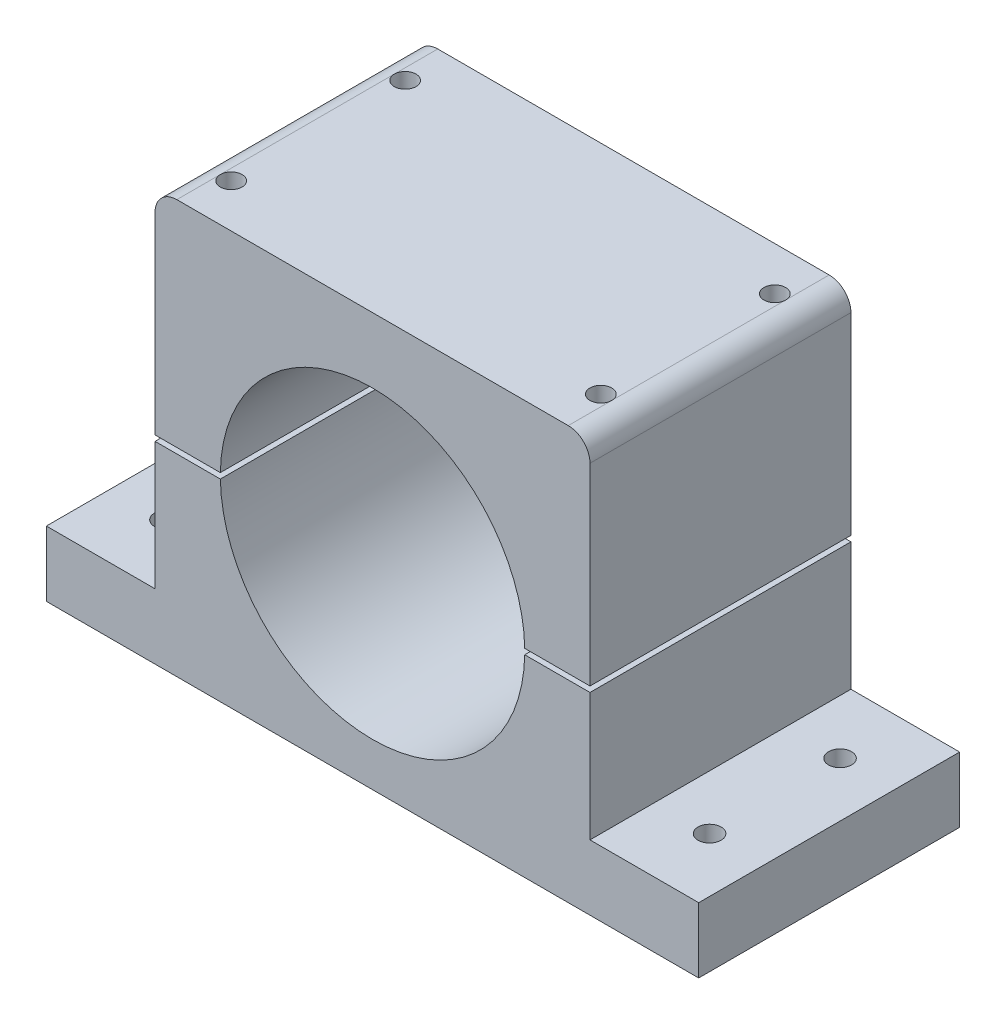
ISO-10303-21;
HEADER;
FILE_DESCRIPTION(('STEP AP214'),'2;1');
FILE_NAME('part.step','',(''),(''),'','','');
FILE_SCHEMA(('AUTOMOTIVE_DESIGN { 1 0 10303 214 1 1 1 1 }'));
ENDSEC;
DATA;
#1=APPLICATION_CONTEXT('core data for automotive mechanical design processes');
#2=APPLICATION_PROTOCOL_DEFINITION('international standard','automotive_design',2000,#1);
#3=PRODUCT_CONTEXT('',#1,'mechanical');
#4=PRODUCT('Part','Part','',(#3));
#5=PRODUCT_RELATED_PRODUCT_CATEGORY('part','',(#4));
#6=PRODUCT_DEFINITION_FORMATION('','',#4);
#7=PRODUCT_DEFINITION_CONTEXT('part definition',#1,'design');
#8=PRODUCT_DEFINITION('design','',#6,#7);
#9=PRODUCT_DEFINITION_SHAPE('','',#8);
#10=(LENGTH_UNIT() NAMED_UNIT(*) SI_UNIT(.MILLI.,.METRE.));
#11=(NAMED_UNIT(*) PLANE_ANGLE_UNIT() SI_UNIT($,.RADIAN.));
#12=(NAMED_UNIT(*) SI_UNIT($,.STERADIAN.) SOLID_ANGLE_UNIT());
#13=UNCERTAINTY_MEASURE_WITH_UNIT(LENGTH_MEASURE(1.E-05),#10,'distance_accuracy_value','');
#14=(GEOMETRIC_REPRESENTATION_CONTEXT(3) GLOBAL_UNCERTAINTY_ASSIGNED_CONTEXT((#13)) GLOBAL_UNIT_ASSIGNED_CONTEXT((#10,
#11,#12)) REPRESENTATION_CONTEXT('',''));
#15=CARTESIAN_POINT('',(0.,0.,0.));
#16=DIRECTION('',(0.,0.,1.));
#17=DIRECTION('',(1.,0.,0.));
#18=AXIS2_PLACEMENT_3D('',#15,#16,#17);
#19=CARTESIAN_POINT('',(-95.25,-57.15,-76.2));
#20=DIRECTION('',(-1.,0.,0.));
#21=DIRECTION('',(0.,0.,1.00000000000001));
#22=AXIS2_PLACEMENT_3D('',#19,#20,#21);
#23=PLANE('',#22);
#24=DIRECTION('',(0.,0.,1.00000000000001));
#25=VECTOR('',#24,1.);
#26=CARTESIAN_POINT('',(-95.25,-38.1,-76.2));
#27=LINE('',#26,#25);
#28=CARTESIAN_POINT('',(-95.25,-38.1,-76.2));
#29=VERTEX_POINT('',#28);
#30=CARTESIAN_POINT('',(-95.25,-38.1,0.));
#31=VERTEX_POINT('',#30);
#32=EDGE_CURVE('E226',#29,#31,#27,.T.);
#33=ORIENTED_EDGE('',*,*,#32,.F.);
#34=DIRECTION('',(0.,-1.,0.));
#35=VECTOR('',#34,1.);
#36=CARTESIAN_POINT('',(-95.25,-57.15,-76.2));
#37=LINE('',#36,#35);
#38=CARTESIAN_POINT('',(-95.25,-57.15,-76.2));
#39=VERTEX_POINT('',#38);
#40=EDGE_CURVE('E236',#29,#39,#37,.T.);
#41=ORIENTED_EDGE('',*,*,#40,.T.);
#42=DIRECTION('',(0.,0.,1.00000000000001));
#43=VECTOR('',#42,1.);
#44=CARTESIAN_POINT('',(-95.25,-57.15,-76.2));
#45=LINE('',#44,#43);
#46=CARTESIAN_POINT('',(-95.25,-57.15,0.));
#47=VERTEX_POINT('',#46);
#48=EDGE_CURVE('E230',#39,#47,#45,.T.);
#49=ORIENTED_EDGE('',*,*,#48,.T.);
#50=DIRECTION('',(0.,-1.,0.));
#51=VECTOR('',#50,1.);
#52=CARTESIAN_POINT('',(-95.25,-57.15,0.));
#53=LINE('',#52,#51);
#54=EDGE_CURVE('E212',#31,#47,#53,.T.);
#55=ORIENTED_EDGE('',*,*,#54,.F.);
#56=EDGE_LOOP('',(#33,#41,#49,#55));
#57=FACE_BOUND('',#56,.T.);
#58=ADVANCED_FACE('F44',(#57),#23,.T.);
#59=CARTESIAN_POINT('',(95.2500000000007,-57.15,-76.2));
#60=DIRECTION('',(1.,0.,0.));
#61=DIRECTION('',(0.,0.,-1.00000000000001));
#62=AXIS2_PLACEMENT_3D('',#59,#60,#61);
#63=PLANE('',#62);
#64=DIRECTION('',(0.,0.,1.00000000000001));
#65=VECTOR('',#64,1.);
#66=CARTESIAN_POINT('',(95.2500000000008,-38.1,-76.2));
#67=LINE('',#66,#65);
#68=CARTESIAN_POINT('',(95.2500000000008,-38.1,-76.2));
#69=VERTEX_POINT('',#68);
#70=CARTESIAN_POINT('',(95.2500000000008,-38.1,0.));
#71=VERTEX_POINT('',#70);
#72=EDGE_CURVE('E145',#69,#71,#67,.T.);
#73=ORIENTED_EDGE('',*,*,#72,.T.);
#74=DIRECTION('',(0.,1.,0.));
#75=VECTOR('',#74,1.);
#76=CARTESIAN_POINT('',(95.2500000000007,-57.15,0.));
#77=LINE('',#76,#75);
#78=CARTESIAN_POINT('',(95.2500000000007,-57.15,0.));
#79=VERTEX_POINT('',#78);
#80=EDGE_CURVE('E215',#79,#71,#77,.T.);
#81=ORIENTED_EDGE('',*,*,#80,.F.);
#82=DIRECTION('',(0.,0.,1.00000000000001));
#83=VECTOR('',#82,1.);
#84=CARTESIAN_POINT('',(95.2500000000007,-57.15,-76.2));
#85=LINE('',#84,#83);
#86=CARTESIAN_POINT('',(95.2500000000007,-57.15,-76.2));
#87=VERTEX_POINT('',#86);
#88=EDGE_CURVE('E244',#87,#79,#85,.T.);
#89=ORIENTED_EDGE('',*,*,#88,.F.);
#90=DIRECTION('',(0.,1.,0.));
#91=VECTOR('',#90,1.);
#92=CARTESIAN_POINT('',(95.2500000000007,-57.15,-76.2));
#93=LINE('',#92,#91);
#94=EDGE_CURVE('E195',#87,#69,#93,.T.);
#95=ORIENTED_EDGE('',*,*,#94,.T.);
#96=EDGE_LOOP('',(#73,#81,#89,#95));
#97=FACE_BOUND('',#96,.T.);
#98=ADVANCED_FACE('F256',(#97),#63,.T.);
#99=CARTESIAN_POINT('',(-95.25,-57.15,-76.2));
#100=DIRECTION('',(0.,-1.,0.));
#101=DIRECTION('',(0.,0.,-1.00000000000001));
#102=AXIS2_PLACEMENT_3D('',#99,#100,#101);
#103=PLANE('',#102);
#104=CARTESIAN_POINT('',(79.3750000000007,-57.15,-19.05));
#105=DIRECTION('',(0.,1.,0.));
#106=DIRECTION('',(0.,0.,1.00000000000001));
#107=AXIS2_PLACEMENT_3D('',#104,#105,#106);
#108=CIRCLE('',#107,3.36549999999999);
#109=CARTESIAN_POINT('',(79.3750000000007,-57.15,-15.6845));
#110=VERTEX_POINT('',#109);
#111=EDGE_CURVE('E190',#110,#110,#108,.T.);
#112=ORIENTED_EDGE('',*,*,#111,.T.);
#113=EDGE_LOOP('',(#112));
#114=FACE_BOUND('',#113,.T.);
#115=CARTESIAN_POINT('',(79.3750000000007,-57.15,-57.15));
#116=DIRECTION('',(0.,1.,0.));
#117=DIRECTION('',(0.,0.,1.00000000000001));
#118=AXIS2_PLACEMENT_3D('',#115,#116,#117);
#119=CIRCLE('',#118,3.36549999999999);
#120=CARTESIAN_POINT('',(79.3750000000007,-57.15,-53.7845));
#121=VERTEX_POINT('',#120);
#122=EDGE_CURVE('E184',#121,#121,#119,.T.);
#123=ORIENTED_EDGE('',*,*,#122,.T.);
#124=EDGE_LOOP('',(#123));
#125=FACE_BOUND('',#124,.T.);
#126=CARTESIAN_POINT('',(-79.375,-57.15,-19.05));
#127=DIRECTION('',(0.,1.,0.));
#128=DIRECTION('',(0.,0.,1.00000000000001));
#129=AXIS2_PLACEMENT_3D('',#126,#127,#128);
#130=CIRCLE('',#129,3.36549999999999);
#131=CARTESIAN_POINT('',(-79.375,-57.15,-15.6845));
#132=VERTEX_POINT('',#131);
#133=EDGE_CURVE('E178',#132,#132,#130,.T.);
#134=ORIENTED_EDGE('',*,*,#133,.T.);
#135=EDGE_LOOP('',(#134));
#136=FACE_BOUND('',#135,.T.);
#137=CARTESIAN_POINT('',(-79.375,-57.15,-57.15));
#138=DIRECTION('',(0.,1.,0.));
#139=DIRECTION('',(0.,0.,1.00000000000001));
#140=AXIS2_PLACEMENT_3D('',#137,#138,#139);
#141=CIRCLE('',#140,3.36549999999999);
#142=CARTESIAN_POINT('',(-79.375,-57.15,-53.7845));
#143=VERTEX_POINT('',#142);
#144=EDGE_CURVE('E174',#143,#143,#141,.T.);
#145=ORIENTED_EDGE('',*,*,#144,.T.);
#146=EDGE_LOOP('',(#145));
#147=FACE_BOUND('',#146,.T.);
#148=DIRECTION('',(1.,0.,0.));
#149=VECTOR('',#148,1.);
#150=CARTESIAN_POINT('',(-95.25,-57.15,0.));
#151=LINE('',#150,#149);
#152=EDGE_CURVE('E247',#47,#79,#151,.T.);
#153=ORIENTED_EDGE('',*,*,#152,.F.);
#154=ORIENTED_EDGE('',*,*,#48,.F.);
#155=DIRECTION('',(1.,0.,0.));
#156=VECTOR('',#155,1.);
#157=CARTESIAN_POINT('',(-95.25,-57.15,-76.2));
#158=LINE('',#157,#156);
#159=EDGE_CURVE('E177',#39,#87,#158,.T.);
#160=ORIENTED_EDGE('',*,*,#159,.T.);
#161=ORIENTED_EDGE('',*,*,#88,.T.);
#162=EDGE_LOOP('',(#153,#154,#160,#161));
#163=FACE_BOUND('',#162,.T.);
#164=ADVANCED_FACE('F254',(#114,#125,#136,#147,#163),#103,.T.);
#165=CARTESIAN_POINT('',(-95.25,63.5,-76.2));
#166=DIRECTION('',(0.,0.,-1.00000000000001));
#167=DIRECTION('',(-1.,0.,0.));
#168=AXIS2_PLACEMENT_3D('',#165,#166,#167);
#169=PLANE('',#168);
#170=DIRECTION('',(1.,0.,0.));
#171=VECTOR('',#170,1.);
#172=CARTESIAN_POINT('',(-63.5,-0.812799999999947,-76.2));
#173=LINE('',#172,#171);
#174=CARTESIAN_POINT('',(44.4425680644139,-0.812799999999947,-76.2));
#175=VERTEX_POINT('',#174);
#176=CARTESIAN_POINT('',(63.5000000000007,-0.812799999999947,-76.2));
#177=VERTEX_POINT('',#176);
#178=EDGE_CURVE('E131',#175,#177,#173,.T.);
#179=ORIENTED_EDGE('',*,*,#178,.T.);
#180=DIRECTION('',(0.,-1.,0.));
#181=VECTOR('',#180,1.);
#182=CARTESIAN_POINT('',(63.5,63.5,-76.2));
#183=LINE('',#182,#181);
#184=CARTESIAN_POINT('',(63.5000000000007,-38.1,-76.2));
#185=VERTEX_POINT('',#184);
#186=EDGE_CURVE('E122',#177,#185,#183,.T.);
#187=ORIENTED_EDGE('',*,*,#186,.T.);
#188=DIRECTION('',(1.,0.,0.));
#189=VECTOR('',#188,1.);
#190=CARTESIAN_POINT('',(95.2500000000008,-38.1,-76.2));
#191=LINE('',#190,#189);
#192=EDGE_CURVE('E127',#185,#69,#191,.T.);
#193=ORIENTED_EDGE('',*,*,#192,.T.);
#194=ORIENTED_EDGE('',*,*,#94,.F.);
#195=ORIENTED_EDGE('',*,*,#159,.F.);
#196=ORIENTED_EDGE('',*,*,#40,.F.);
#197=DIRECTION('',(1.,0.,0.));
#198=VECTOR('',#197,1.);
#199=CARTESIAN_POINT('',(-95.25,-38.1,-76.2));
#200=LINE('',#199,#198);
#201=CARTESIAN_POINT('',(-63.5,-38.1,-76.2));
#202=VERTEX_POINT('',#201);
#203=EDGE_CURVE('E146',#29,#202,#200,.T.);
#204=ORIENTED_EDGE('',*,*,#203,.T.);
#205=DIRECTION('',(0.,1.,0.));
#206=VECTOR('',#205,1.);
#207=CARTESIAN_POINT('',(-63.5,63.5,-76.2));
#208=LINE('',#207,#206);
#209=CARTESIAN_POINT('',(-63.5,-0.812799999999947,-76.2));
#210=VERTEX_POINT('',#209);
#211=EDGE_CURVE('E149',#202,#210,#208,.T.);
#212=ORIENTED_EDGE('',*,*,#211,.T.);
#213=CARTESIAN_POINT('',(-44.4425680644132,-0.812799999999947,-76.2));
#214=VERTEX_POINT('',#213);
#215=EDGE_CURVE('E79',#210,#214,#173,.T.);
#216=ORIENTED_EDGE('',*,*,#215,.T.);
#217=CARTESIAN_POINT('',(0.,0.,-76.2));
#218=DIRECTION('',(0.,0.,1.00000000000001));
#219=DIRECTION('',(1.,0.,0.));
#220=AXIS2_PLACEMENT_3D('',#217,#218,#219);
#221=CIRCLE('',#220,44.45);
#222=EDGE_CURVE('E210',#214,#175,#221,.T.);
#223=ORIENTED_EDGE('',*,*,#222,.T.);
#224=EDGE_LOOP('',(#179,#187,#193,#194,#195,#196,#204,#212,#216,#223));
#225=FACE_BOUND('',#224,.T.);
#226=ADVANCED_FACE('F124',(#225),#169,.T.);
#227=CARTESIAN_POINT('',(-95.25,63.5,0.));
#228=DIRECTION('',(0.,0.,-1.00000000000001));
#229=DIRECTION('',(-1.,0.,0.));
#230=AXIS2_PLACEMENT_3D('',#227,#228,#229);
#231=PLANE('',#230);
#232=DIRECTION('',(0.,-1.,0.));
#233=VECTOR('',#232,1.);
#234=CARTESIAN_POINT('',(63.5,63.5,0.));
#235=LINE('',#234,#233);
#236=CARTESIAN_POINT('',(63.5000000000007,-0.812800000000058,0.));
#237=VERTEX_POINT('',#236);
#238=CARTESIAN_POINT('',(63.5000000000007,-38.1,0.));
#239=VERTEX_POINT('',#238);
#240=EDGE_CURVE('E48',#237,#239,#235,.T.);
#241=ORIENTED_EDGE('',*,*,#240,.F.);
#242=DIRECTION('',(1.,0.,0.));
#243=VECTOR('',#242,1.);
#244=CARTESIAN_POINT('',(-63.5,-0.812799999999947,0.));
#245=LINE('',#244,#243);
#246=CARTESIAN_POINT('',(44.4425680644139,-0.812799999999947,0.));
#247=VERTEX_POINT('',#246);
#248=EDGE_CURVE('E166',#247,#237,#245,.T.);
#249=ORIENTED_EDGE('',*,*,#248,.F.);
#250=CARTESIAN_POINT('',(0.,0.,0.));
#251=DIRECTION('',(0.,0.,1.00000000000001));
#252=DIRECTION('',(1.,0.,0.));
#253=AXIS2_PLACEMENT_3D('',#250,#251,#252);
#254=CIRCLE('',#253,44.45);
#255=CARTESIAN_POINT('',(-44.4425680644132,-0.812799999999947,0.));
#256=VERTEX_POINT('',#255);
#257=EDGE_CURVE('E199',#256,#247,#254,.T.);
#258=ORIENTED_EDGE('',*,*,#257,.F.);
#259=CARTESIAN_POINT('',(-63.5,-0.812799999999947,0.));
#260=VERTEX_POINT('',#259);
#261=EDGE_CURVE('E158',#260,#256,#245,.T.);
#262=ORIENTED_EDGE('',*,*,#261,.F.);
#263=DIRECTION('',(0.,1.,0.));
#264=VECTOR('',#263,1.);
#265=CARTESIAN_POINT('',(-63.5,63.5,0.));
#266=LINE('',#265,#264);
#267=CARTESIAN_POINT('',(-63.5,-38.1,0.));
#268=VERTEX_POINT('',#267);
#269=EDGE_CURVE('E201',#268,#260,#266,.T.);
#270=ORIENTED_EDGE('',*,*,#269,.F.);
#271=DIRECTION('',(1.,0.,0.));
#272=VECTOR('',#271,1.);
#273=CARTESIAN_POINT('',(-95.25,-38.1,0.));
#274=LINE('',#273,#272);
#275=EDGE_CURVE('E222',#31,#268,#274,.T.);
#276=ORIENTED_EDGE('',*,*,#275,.F.);
#277=ORIENTED_EDGE('',*,*,#54,.T.);
#278=ORIENTED_EDGE('',*,*,#152,.T.);
#279=ORIENTED_EDGE('',*,*,#80,.T.);
#280=DIRECTION('',(1.,0.,0.));
#281=VECTOR('',#280,1.);
#282=CARTESIAN_POINT('',(95.2500000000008,-38.1,0.));
#283=LINE('',#282,#281);
#284=EDGE_CURVE('E141',#239,#71,#283,.T.);
#285=ORIENTED_EDGE('',*,*,#284,.F.);
#286=EDGE_LOOP('',(#241,#249,#258,#262,#270,#276,#277,#278,#279,#285));
#287=FACE_BOUND('',#286,.T.);
#288=ADVANCED_FACE('F258',(#287),#231,.F.);
#289=CARTESIAN_POINT('',(0.,0.,-76.2));
#290=DIRECTION('',(0.,0.,1.00000000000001));
#291=DIRECTION('',(1.,0.,0.));
#292=AXIS2_PLACEMENT_3D('',#289,#290,#291);
#293=CYLINDRICAL_SURFACE('',#292,44.45);
#294=ORIENTED_EDGE('',*,*,#257,.T.);
#295=DIRECTION('',(0.,0.,1.00000000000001));
#296=VECTOR('',#295,1.);
#297=CARTESIAN_POINT('',(44.4425680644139,-0.812799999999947,-76.2));
#298=LINE('',#297,#296);
#299=EDGE_CURVE('E196',#247,#175,#298,.F.);
#300=ORIENTED_EDGE('',*,*,#299,.T.);
#301=ORIENTED_EDGE('',*,*,#222,.F.);
#302=DIRECTION('',(0.,0.,1.00000000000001));
#303=VECTOR('',#302,1.);
#304=CARTESIAN_POINT('',(-44.4425680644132,-0.812799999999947,-76.2));
#305=LINE('',#304,#303);
#306=EDGE_CURVE('E63',#214,#256,#305,.T.);
#307=ORIENTED_EDGE('',*,*,#306,.T.);
#308=EDGE_LOOP('',(#294,#300,#301,#307));
#309=FACE_BOUND('',#308,.T.);
#310=ADVANCED_FACE('F267',(#309),#293,.F.);
#311=CARTESIAN_POINT('',(-63.5,63.5,-76.2));
#312=DIRECTION('',(1.,0.,0.));
#313=DIRECTION('',(0.,1.,0.));
#314=AXIS2_PLACEMENT_3D('',#311,#312,#313);
#315=PLANE('',#314);
#316=ORIENTED_EDGE('',*,*,#269,.T.);
#317=DIRECTION('',(0.,0.,1.00000000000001));
#318=VECTOR('',#317,1.);
#319=CARTESIAN_POINT('',(-63.5,-0.812799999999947,-76.2));
#320=LINE('',#319,#318);
#321=EDGE_CURVE('E76',#210,#260,#320,.T.);
#322=ORIENTED_EDGE('',*,*,#321,.F.);
#323=ORIENTED_EDGE('',*,*,#211,.F.);
#324=DIRECTION('',(0.,0.,1.00000000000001));
#325=VECTOR('',#324,1.);
#326=CARTESIAN_POINT('',(-63.5,-38.1,-76.2));
#327=LINE('',#326,#325);
#328=EDGE_CURVE('E219',#202,#268,#327,.T.);
#329=ORIENTED_EDGE('',*,*,#328,.T.);
#330=EDGE_LOOP('',(#316,#322,#323,#329));
#331=FACE_BOUND('',#330,.T.);
#332=ADVANCED_FACE('F305',(#331),#315,.F.);
#333=CARTESIAN_POINT('',(-95.25,-38.1,-76.2));
#334=DIRECTION('',(0.,-1.,0.));
#335=DIRECTION('',(0.,0.,-1.00000000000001));
#336=AXIS2_PLACEMENT_3D('',#333,#334,#335);
#337=PLANE('',#336);
#338=CARTESIAN_POINT('',(-79.375,-38.1,-19.05));
#339=DIRECTION('',(0.,1.,0.));
#340=DIRECTION('',(0.,0.,1.00000000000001));
#341=AXIS2_PLACEMENT_3D('',#338,#339,#340);
#342=CIRCLE('',#341,3.36549999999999);
#343=CARTESIAN_POINT('',(-79.375,-38.1,-15.6845));
#344=VERTEX_POINT('',#343);
#345=EDGE_CURVE('E173',#344,#344,#342,.T.);
#346=ORIENTED_EDGE('',*,*,#345,.F.);
#347=EDGE_LOOP('',(#346));
#348=FACE_BOUND('',#347,.T.);
#349=CARTESIAN_POINT('',(-79.375,-38.1,-57.15));
#350=DIRECTION('',(0.,1.,0.));
#351=DIRECTION('',(0.,0.,1.00000000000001));
#352=AXIS2_PLACEMENT_3D('',#349,#350,#351);
#353=CIRCLE('',#352,3.36549999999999);
#354=CARTESIAN_POINT('',(-79.375,-38.1,-53.7845));
#355=VERTEX_POINT('',#354);
#356=EDGE_CURVE('E170',#355,#355,#353,.T.);
#357=ORIENTED_EDGE('',*,*,#356,.F.);
#358=EDGE_LOOP('',(#357));
#359=FACE_BOUND('',#358,.T.);
#360=ORIENTED_EDGE('',*,*,#275,.T.);
#361=ORIENTED_EDGE('',*,*,#328,.F.);
#362=ORIENTED_EDGE('',*,*,#203,.F.);
#363=ORIENTED_EDGE('',*,*,#32,.T.);
#364=EDGE_LOOP('',(#360,#361,#362,#363));
#365=FACE_BOUND('',#364,.T.);
#366=ADVANCED_FACE('F302',(#348,#359,#365),#337,.F.);
#367=CARTESIAN_POINT('',(95.2500000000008,-38.1,-76.2));
#368=DIRECTION('',(0.,-1.,0.));
#369=DIRECTION('',(1.,0.,0.));
#370=AXIS2_PLACEMENT_3D('',#367,#368,#369);
#371=PLANE('',#370);
#372=CARTESIAN_POINT('',(79.3750000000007,-38.1,-19.05));
#373=DIRECTION('',(0.,1.,0.));
#374=DIRECTION('',(0.,0.,1.00000000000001));
#375=AXIS2_PLACEMENT_3D('',#372,#373,#374);
#376=CIRCLE('',#375,3.36549999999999);
#377=CARTESIAN_POINT('',(79.3750000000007,-38.1,-15.6845));
#378=VERTEX_POINT('',#377);
#379=EDGE_CURVE('E187',#378,#378,#376,.T.);
#380=ORIENTED_EDGE('',*,*,#379,.F.);
#381=EDGE_LOOP('',(#380));
#382=FACE_BOUND('',#381,.T.);
#383=CARTESIAN_POINT('',(79.3750000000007,-38.1,-57.15));
#384=DIRECTION('',(0.,1.,0.));
#385=DIRECTION('',(0.,0.,1.00000000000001));
#386=AXIS2_PLACEMENT_3D('',#383,#384,#385);
#387=CIRCLE('',#386,3.36549999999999);
#388=CARTESIAN_POINT('',(79.3750000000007,-38.1,-53.7845));
#389=VERTEX_POINT('',#388);
#390=EDGE_CURVE('E181',#389,#389,#387,.T.);
#391=ORIENTED_EDGE('',*,*,#390,.F.);
#392=EDGE_LOOP('',(#391));
#393=FACE_BOUND('',#392,.T.);
#394=ORIENTED_EDGE('',*,*,#284,.T.);
#395=ORIENTED_EDGE('',*,*,#72,.F.);
#396=ORIENTED_EDGE('',*,*,#192,.F.);
#397=DIRECTION('',(0.,0.,1.00000000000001));
#398=VECTOR('',#397,1.);
#399=CARTESIAN_POINT('',(63.5000000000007,-38.1,-76.2));
#400=LINE('',#399,#398);
#401=EDGE_CURVE('E135',#185,#239,#400,.T.);
#402=ORIENTED_EDGE('',*,*,#401,.T.);
#403=EDGE_LOOP('',(#394,#395,#396,#402));
#404=FACE_BOUND('',#403,.T.);
#405=ADVANCED_FACE('F143',(#382,#393,#404),#371,.F.);
#406=CARTESIAN_POINT('',(63.5,63.5,-76.2));
#407=DIRECTION('',(-1.,0.,0.));
#408=DIRECTION('',(0.,-1.,0.));
#409=AXIS2_PLACEMENT_3D('',#406,#407,#408);
#410=PLANE('',#409);
#411=ORIENTED_EDGE('',*,*,#186,.F.);
#412=DIRECTION('',(0.,0.,1.00000000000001));
#413=VECTOR('',#412,1.);
#414=CARTESIAN_POINT('',(63.5000000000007,-0.812799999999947,-76.2));
#415=LINE('',#414,#413);
#416=EDGE_CURVE('E140',#177,#237,#415,.T.);
#417=ORIENTED_EDGE('',*,*,#416,.T.);
#418=ORIENTED_EDGE('',*,*,#240,.T.);
#419=ORIENTED_EDGE('',*,*,#401,.F.);
#420=EDGE_LOOP('',(#411,#417,#418,#419));
#421=FACE_BOUND('',#420,.T.);
#422=ADVANCED_FACE('F136',(#421),#410,.F.);
#423=CARTESIAN_POINT('',(-79.375,-57.15,-57.15));
#424=DIRECTION('',(0.,1.,0.));
#425=DIRECTION('',(0.,0.,1.00000000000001));
#426=AXIS2_PLACEMENT_3D('',#423,#424,#425);
#427=CYLINDRICAL_SURFACE('',#426,3.36549999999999);
#428=ORIENTED_EDGE('',*,*,#144,.F.);
#429=EDGE_LOOP('',(#428));
#430=FACE_BOUND('',#429,.T.);
#431=ORIENTED_EDGE('',*,*,#356,.T.);
#432=EDGE_LOOP('',(#431));
#433=FACE_BOUND('',#432,.T.);
#434=ADVANCED_FACE('F323',(#430,#433),#427,.F.);
#435=CARTESIAN_POINT('',(-79.375,-57.15,-19.05));
#436=DIRECTION('',(0.,1.,0.));
#437=DIRECTION('',(0.,0.,1.00000000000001));
#438=AXIS2_PLACEMENT_3D('',#435,#436,#437);
#439=CYLINDRICAL_SURFACE('',#438,3.36549999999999);
#440=ORIENTED_EDGE('',*,*,#133,.F.);
#441=EDGE_LOOP('',(#440));
#442=FACE_BOUND('',#441,.T.);
#443=ORIENTED_EDGE('',*,*,#345,.T.);
#444=EDGE_LOOP('',(#443));
#445=FACE_BOUND('',#444,.T.);
#446=ADVANCED_FACE('F326',(#442,#445),#439,.F.);
#447=CARTESIAN_POINT('',(79.3750000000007,-57.15,-57.15));
#448=DIRECTION('',(0.,1.,0.));
#449=DIRECTION('',(0.,0.,1.00000000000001));
#450=AXIS2_PLACEMENT_3D('',#447,#448,#449);
#451=CYLINDRICAL_SURFACE('',#450,3.36549999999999);
#452=ORIENTED_EDGE('',*,*,#122,.F.);
#453=EDGE_LOOP('',(#452));
#454=FACE_BOUND('',#453,.T.);
#455=ORIENTED_EDGE('',*,*,#390,.T.);
#456=EDGE_LOOP('',(#455));
#457=FACE_BOUND('',#456,.T.);
#458=ADVANCED_FACE('F283',(#454,#457),#451,.F.);
#459=CARTESIAN_POINT('',(79.3750000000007,-57.15,-19.05));
#460=DIRECTION('',(0.,1.,0.));
#461=DIRECTION('',(0.,0.,1.00000000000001));
#462=AXIS2_PLACEMENT_3D('',#459,#460,#461);
#463=CYLINDRICAL_SURFACE('',#462,3.36549999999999);
#464=ORIENTED_EDGE('',*,*,#111,.F.);
#465=EDGE_LOOP('',(#464));
#466=FACE_BOUND('',#465,.T.);
#467=ORIENTED_EDGE('',*,*,#379,.T.);
#468=EDGE_LOOP('',(#467));
#469=FACE_BOUND('',#468,.T.);
#470=ADVANCED_FACE('F272',(#466,#469),#463,.F.);
#471=CARTESIAN_POINT('',(-63.5,-0.812799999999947,-76.2));
#472=DIRECTION('',(0.,-1.,0.));
#473=DIRECTION('',(1.,0.,0.));
#474=AXIS2_PLACEMENT_3D('',#471,#472,#473);
#475=PLANE('',#474);
#476=CARTESIAN_POINT('',(53.9750000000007,-0.812800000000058,-63.5000000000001));
#477=DIRECTION('',(0.,-1.,0.));
#478=DIRECTION('',(1.,0.,0.));
#479=AXIS2_PLACEMENT_3D('',#476,#477,#478);
#480=CIRCLE('',#479,3.175);
#481=CARTESIAN_POINT('',(53.9750000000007,-0.812800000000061,-60.3250000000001));
#482=VERTEX_POINT('',#481);
#483=EDGE_CURVE('E165',#482,#482,#480,.F.);
#484=ORIENTED_EDGE('',*,*,#483,.F.);
#485=EDGE_LOOP('',(#484));
#486=FACE_BOUND('',#485,.T.);
#487=CARTESIAN_POINT('',(53.9750000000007,-0.812799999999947,-12.6999999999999));
#488=DIRECTION('',(0.,-1.,0.));
#489=DIRECTION('',(1.,0.,0.));
#490=AXIS2_PLACEMENT_3D('',#487,#488,#489);
#491=CIRCLE('',#490,3.175);
#492=CARTESIAN_POINT('',(53.9750000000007,-0.81279999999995,-9.52499999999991));
#493=VERTEX_POINT('',#492);
#494=EDGE_CURVE('E161',#493,#493,#491,.F.);
#495=ORIENTED_EDGE('',*,*,#494,.F.);
#496=EDGE_LOOP('',(#495));
#497=FACE_BOUND('',#496,.T.);
#498=ORIENTED_EDGE('',*,*,#248,.T.);
#499=ORIENTED_EDGE('',*,*,#416,.F.);
#500=ORIENTED_EDGE('',*,*,#178,.F.);
#501=ORIENTED_EDGE('',*,*,#299,.F.);
#502=EDGE_LOOP('',(#498,#499,#500,#501));
#503=FACE_BOUND('',#502,.T.);
#504=ADVANCED_FACE('F269',(#486,#497,#503),#475,.F.);
#505=CARTESIAN_POINT('',(53.9750000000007,-12.7,-63.5000000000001));
#506=DIRECTION('',(0.,1.,0.));
#507=DIRECTION('',(0.,0.,1.00000000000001));
#508=AXIS2_PLACEMENT_3D('',#505,#506,#507);
#509=PLANE('',#508);
#510=CARTESIAN_POINT('',(53.9750000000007,-12.7,-63.5000000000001));
#511=DIRECTION('',(0.,1.,0.));
#512=DIRECTION('',(0.,0.,1.00000000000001));
#513=AXIS2_PLACEMENT_3D('',#510,#511,#512);
#514=CIRCLE('',#513,3.175);
#515=CARTESIAN_POINT('',(53.9750000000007,-12.7,-60.3250000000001));
#516=VERTEX_POINT('',#515);
#517=EDGE_CURVE('E162',#516,#516,#514,.T.);
#518=ORIENTED_EDGE('',*,*,#517,.T.);
#519=EDGE_LOOP('',(#518));
#520=FACE_BOUND('',#519,.T.);
#521=ADVANCED_FACE('F271',(#520),#509,.T.);
#522=CARTESIAN_POINT('',(53.9750000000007,-12.7,-63.5000000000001));
#523=DIRECTION('',(0.,1.,0.));
#524=DIRECTION('',(0.,0.,1.00000000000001));
#525=AXIS2_PLACEMENT_3D('',#522,#523,#524);
#526=CYLINDRICAL_SURFACE('',#525,3.175);
#527=CARTESIAN_POINT('',(53.9750000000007,-0.812800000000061,-60.3250000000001));
#528=CARTESIAN_POINT('',(53.9750000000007,-0.936625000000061,-60.3250000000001));
#529=CARTESIAN_POINT('',(53.9750000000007,-1.06045000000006,-60.3250000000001));
#530=CARTESIAN_POINT('',(53.9750000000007,-1.30810000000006,-60.3250000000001));
#531=CARTESIAN_POINT('',(53.9750000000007,-1.43192500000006,-60.3250000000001));
#532=CARTESIAN_POINT('',(53.9750000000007,-1.67957500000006,-60.3250000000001));
#533=CARTESIAN_POINT('',(53.9750000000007,-1.80340000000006,-60.3250000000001));
#534=CARTESIAN_POINT('',(53.9750000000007,-2.05105000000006,-60.3250000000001));
#535=CARTESIAN_POINT('',(53.9750000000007,-2.17487500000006,-60.3250000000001));
#536=CARTESIAN_POINT('',(53.9750000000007,-2.42252500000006,-60.3250000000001));
#537=CARTESIAN_POINT('',(53.9750000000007,-2.54635000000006,-60.3250000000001));
#538=CARTESIAN_POINT('',(53.9750000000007,-2.79400000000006,-60.3250000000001));
#539=CARTESIAN_POINT('',(53.9750000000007,-2.91782500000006,-60.3250000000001));
#540=CARTESIAN_POINT('',(53.9750000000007,-3.16547500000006,-60.3250000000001));
#541=CARTESIAN_POINT('',(53.9750000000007,-3.28930000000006,-60.3250000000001));
#542=CARTESIAN_POINT('',(53.9750000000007,-3.53695000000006,-60.3250000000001));
#543=CARTESIAN_POINT('',(53.9750000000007,-3.66077500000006,-60.3250000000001));
#544=CARTESIAN_POINT('',(53.9750000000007,-3.90842500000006,-60.3250000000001));
#545=CARTESIAN_POINT('',(53.9750000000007,-4.03225000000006,-60.3250000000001));
#546=CARTESIAN_POINT('',(53.9750000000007,-4.27990000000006,-60.3250000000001));
#547=CARTESIAN_POINT('',(53.9750000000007,-4.40372500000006,-60.3250000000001));
#548=CARTESIAN_POINT('',(53.9750000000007,-4.65137500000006,-60.3250000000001));
#549=CARTESIAN_POINT('',(53.9750000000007,-4.77520000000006,-60.3250000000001));
#550=CARTESIAN_POINT('',(53.9750000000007,-5.02285000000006,-60.3250000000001));
#551=CARTESIAN_POINT('',(53.9750000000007,-5.14667500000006,-60.3250000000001));
#552=CARTESIAN_POINT('',(53.9750000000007,-5.39432500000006,-60.3250000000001));
#553=CARTESIAN_POINT('',(53.9750000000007,-5.51815000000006,-60.3250000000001));
#554=CARTESIAN_POINT('',(53.9750000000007,-5.76580000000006,-60.3250000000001));
#555=CARTESIAN_POINT('',(53.9750000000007,-5.88962500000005,-60.3250000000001));
#556=CARTESIAN_POINT('',(53.9750000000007,-6.13727500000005,-60.3250000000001));
#557=CARTESIAN_POINT('',(53.9750000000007,-6.26110000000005,-60.3250000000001));
#558=CARTESIAN_POINT('',(53.9750000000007,-6.50875000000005,-60.3250000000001));
#559=CARTESIAN_POINT('',(53.9750000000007,-6.63257500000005,-60.3250000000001));
#560=CARTESIAN_POINT('',(53.9750000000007,-6.88022500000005,-60.3250000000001));
#561=CARTESIAN_POINT('',(53.9750000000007,-7.00405000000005,-60.3250000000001));
#562=CARTESIAN_POINT('',(53.9750000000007,-7.25170000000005,-60.3250000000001));
#563=CARTESIAN_POINT('',(53.9750000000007,-7.37552500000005,-60.3250000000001));
#564=CARTESIAN_POINT('',(53.9750000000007,-7.62317500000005,-60.3250000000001));
#565=CARTESIAN_POINT('',(53.9750000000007,-7.74700000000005,-60.3250000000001));
#566=CARTESIAN_POINT('',(53.9750000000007,-7.99465000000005,-60.3250000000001));
#567=CARTESIAN_POINT('',(53.9750000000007,-8.11847500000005,-60.3250000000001));
#568=CARTESIAN_POINT('',(53.9750000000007,-8.36612500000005,-60.3250000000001));
#569=CARTESIAN_POINT('',(53.9750000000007,-8.48995000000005,-60.3250000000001));
#570=CARTESIAN_POINT('',(53.9750000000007,-8.73760000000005,-60.3250000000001));
#571=CARTESIAN_POINT('',(53.9750000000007,-8.86142500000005,-60.3250000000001));
#572=CARTESIAN_POINT('',(53.9750000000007,-9.10907500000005,-60.3250000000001));
#573=CARTESIAN_POINT('',(53.9750000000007,-9.23290000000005,-60.3250000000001));
#574=CARTESIAN_POINT('',(53.9750000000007,-9.48055000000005,-60.3250000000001));
#575=CARTESIAN_POINT('',(53.9750000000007,-9.60437500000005,-60.3250000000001));
#576=CARTESIAN_POINT('',(53.9750000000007,-9.85202500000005,-60.3250000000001));
#577=CARTESIAN_POINT('',(53.9750000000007,-9.97585000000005,-60.3250000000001));
#578=CARTESIAN_POINT('',(53.9750000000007,-10.2235,-60.3250000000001));
#579=CARTESIAN_POINT('',(53.9750000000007,-10.347325,-60.3250000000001));
#580=CARTESIAN_POINT('',(53.9750000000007,-10.594975,-60.3250000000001));
#581=CARTESIAN_POINT('',(53.9750000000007,-10.7188,-60.3250000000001));
#582=CARTESIAN_POINT('',(53.9750000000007,-10.96645,-60.3250000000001));
#583=CARTESIAN_POINT('',(53.9750000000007,-11.090275,-60.3250000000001));
#584=CARTESIAN_POINT('',(53.9750000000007,-11.337925,-60.3250000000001));
#585=CARTESIAN_POINT('',(53.9750000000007,-11.46175,-60.3250000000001));
#586=CARTESIAN_POINT('',(53.9750000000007,-11.7094,-60.3250000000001));
#587=CARTESIAN_POINT('',(53.9750000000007,-11.833225,-60.3250000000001));
#588=CARTESIAN_POINT('',(53.9750000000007,-12.080875,-60.3250000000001));
#589=CARTESIAN_POINT('',(53.9750000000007,-12.2047,-60.3250000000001));
#590=CARTESIAN_POINT('',(53.9750000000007,-12.45235,-60.3250000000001));
#591=CARTESIAN_POINT('',(53.9750000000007,-12.576175,-60.3250000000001));
#592=CARTESIAN_POINT('',(53.9750000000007,-12.7,-60.3250000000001));
#593=B_SPLINE_CURVE_WITH_KNOTS('',3,(#527,#528,#529,#530,#531,#532,#533,#534,#535,#536,#537,
#538,#539,#540,#541,#542,#543,#544,#545,#546,#547,#548,#549,#550,#551,#552,#553,#554,#555,#556,
#557,#558,#559,#560,#561,#562,#563,#564,#565,#566,#567,#568,#569,#570,#571,#572,#573,#574,#575,
#576,#577,#578,#579,#580,#581,#582,#583,#584,#585,#586,#587,#588,#589,#590,#591,#592),
.UNSPECIFIED.,.F.,.F.,(4,2,2,2,2,2,2,2,2,2,2,2,2,2,2,2,2,2,2,2,2,2,2,2,2,2,2,2,2,2,2,2,4),(0.,
0.371475,0.742949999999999,1.114425,1.4859,1.857375,2.22885,2.600325,2.9718,3.343275,3.71475,
4.08622499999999,4.45769999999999,4.82917499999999,5.20064999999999,5.57212499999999,
5.94359999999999,6.31507499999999,6.68654999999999,7.05802499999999,7.42949999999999,
7.80097499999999,8.17244999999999,8.54392499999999,8.91539999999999,9.28687499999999,
9.65834999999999,10.029825,10.4013,10.772775,11.14425,11.515725,11.8872),.UNSPECIFIED.);
#594=EDGE_CURVE('BSEAM280',#482,#516,#593,.T.);
#595=ORIENTED_EDGE('',*,*,#483,.T.);
#596=ORIENTED_EDGE('',*,*,#517,.F.);
#597=ORIENTED_EDGE('',*,*,#594,.T.);
#598=ORIENTED_EDGE('',*,*,#594,.F.);
#599=EDGE_LOOP('',(#595,#597,#596,#598));
#600=FACE_BOUND('',#599,.T.);
#601=ADVANCED_FACE('F280',(#600),#526,.F.);
#602=CARTESIAN_POINT('',(-53.975,-0.812799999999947,-63.5000000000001));
#603=DIRECTION('',(0.,-1.,0.));
#604=DIRECTION('',(1.,0.,0.));
#605=AXIS2_PLACEMENT_3D('',#602,#603,#604);
#606=CIRCLE('',#605,3.175);
#607=CARTESIAN_POINT('',(-53.975,-0.81279999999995,-60.3250000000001));
#608=VERTEX_POINT('',#607);
#609=EDGE_CURVE('E157',#608,#608,#606,.F.);
#610=ORIENTED_EDGE('',*,*,#609,.F.);
#611=EDGE_LOOP('',(#610));
#612=FACE_BOUND('',#611,.T.);
#613=CARTESIAN_POINT('',(-53.975,-0.812799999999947,-12.6999999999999));
#614=DIRECTION('',(0.,-1.,0.));
#615=DIRECTION('',(1.,0.,0.));
#616=AXIS2_PLACEMENT_3D('',#613,#614,#615);
#617=CIRCLE('',#616,3.175);
#618=CARTESIAN_POINT('',(-53.975,-0.81279999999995,-9.52499999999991));
#619=VERTEX_POINT('',#618);
#620=EDGE_CURVE('E12',#619,#619,#617,.F.);
#621=ORIENTED_EDGE('',*,*,#620,.F.);
#622=EDGE_LOOP('',(#621));
#623=FACE_BOUND('',#622,.T.);
#624=ORIENTED_EDGE('',*,*,#215,.F.);
#625=ORIENTED_EDGE('',*,*,#321,.T.);
#626=ORIENTED_EDGE('',*,*,#261,.T.);
#627=ORIENTED_EDGE('',*,*,#306,.F.);
#628=EDGE_LOOP('',(#624,#625,#626,#627));
#629=FACE_BOUND('',#628,.T.);
#630=ADVANCED_FACE('F275',(#612,#623,#629),#475,.F.);
#631=CARTESIAN_POINT('',(-53.975,-12.7,-63.5000000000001));
#632=DIRECTION('',(0.,1.,0.));
#633=DIRECTION('',(0.,0.,1.00000000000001));
#634=AXIS2_PLACEMENT_3D('',#631,#632,#633);
#635=PLANE('',#634);
#636=CARTESIAN_POINT('',(-53.975,-12.7,-63.5000000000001));
#637=DIRECTION('',(0.,1.,0.));
#638=DIRECTION('',(0.,0.,1.00000000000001));
#639=AXIS2_PLACEMENT_3D('',#636,#637,#638);
#640=CIRCLE('',#639,3.175);
#641=CARTESIAN_POINT('',(-53.975,-12.7,-60.3250000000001));
#642=VERTEX_POINT('',#641);
#643=EDGE_CURVE('E154',#642,#642,#640,.T.);
#644=ORIENTED_EDGE('',*,*,#643,.T.);
#645=EDGE_LOOP('',(#644));
#646=FACE_BOUND('',#645,.T.);
#647=ADVANCED_FACE('F290',(#646),#635,.T.);
#648=CARTESIAN_POINT('',(-53.975,-12.7,-63.5000000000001));
#649=DIRECTION('',(0.,1.,0.));
#650=DIRECTION('',(0.,0.,1.00000000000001));
#651=AXIS2_PLACEMENT_3D('',#648,#649,#650);
#652=CYLINDRICAL_SURFACE('',#651,3.175);
#653=CARTESIAN_POINT('',(-53.975,-0.81279999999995,-60.3250000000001));
#654=CARTESIAN_POINT('',(-53.975,-0.936624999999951,-60.3250000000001));
#655=CARTESIAN_POINT('',(-53.975,-1.06044999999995,-60.3250000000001));
#656=CARTESIAN_POINT('',(-53.975,-1.30809999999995,-60.3250000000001));
#657=CARTESIAN_POINT('',(-53.975,-1.43192499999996,-60.3250000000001));
#658=CARTESIAN_POINT('',(-53.975,-1.67957499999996,-60.3250000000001));
#659=CARTESIAN_POINT('',(-53.975,-1.80339999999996,-60.3250000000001));
#660=CARTESIAN_POINT('',(-53.975,-2.05104999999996,-60.3250000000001));
#661=CARTESIAN_POINT('',(-53.975,-2.17487499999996,-60.3250000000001));
#662=CARTESIAN_POINT('',(-53.975,-2.42252499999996,-60.3250000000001));
#663=CARTESIAN_POINT('',(-53.975,-2.54634999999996,-60.3250000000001));
#664=CARTESIAN_POINT('',(-53.975,-2.79399999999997,-60.3250000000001));
#665=CARTESIAN_POINT('',(-53.975,-2.91782499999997,-60.3250000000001));
#666=CARTESIAN_POINT('',(-53.975,-3.16547499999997,-60.3250000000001));
#667=CARTESIAN_POINT('',(-53.975,-3.28929999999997,-60.3250000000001));
#668=CARTESIAN_POINT('',(-53.975,-3.53694999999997,-60.3250000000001));
#669=CARTESIAN_POINT('',(-53.975,-3.66077499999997,-60.3250000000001));
#670=CARTESIAN_POINT('',(-53.975,-3.90842499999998,-60.3250000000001));
#671=CARTESIAN_POINT('',(-53.975,-4.03224999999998,-60.3250000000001));
#672=CARTESIAN_POINT('',(-53.975,-4.27989999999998,-60.3250000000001));
#673=CARTESIAN_POINT('',(-53.975,-4.40372499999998,-60.3250000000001));
#674=CARTESIAN_POINT('',(-53.975,-4.65137499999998,-60.3250000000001));
#675=CARTESIAN_POINT('',(-53.975,-4.77519999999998,-60.3250000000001));
#676=CARTESIAN_POINT('',(-53.975,-5.02284999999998,-60.3250000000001));
#677=CARTESIAN_POINT('',(-53.975,-5.14667499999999,-60.3250000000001));
#678=CARTESIAN_POINT('',(-53.975,-5.39432499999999,-60.3250000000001));
#679=CARTESIAN_POINT('',(-53.975,-5.51814999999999,-60.3250000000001));
#680=CARTESIAN_POINT('',(-53.975,-5.76579999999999,-60.3250000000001));
#681=CARTESIAN_POINT('',(-53.975,-5.88962499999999,-60.3250000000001));
#682=CARTESIAN_POINT('',(-53.975,-6.13727499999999,-60.3250000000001));
#683=CARTESIAN_POINT('',(-53.975,-6.2611,-60.3250000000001));
#684=CARTESIAN_POINT('',(-53.975,-6.50875,-60.3250000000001));
#685=CARTESIAN_POINT('',(-53.975,-6.632575,-60.3250000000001));
#686=CARTESIAN_POINT('',(-53.975,-6.880225,-60.3250000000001));
#687=CARTESIAN_POINT('',(-53.975,-7.00405,-60.3250000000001));
#688=CARTESIAN_POINT('',(-53.975,-7.2517,-60.3250000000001));
#689=CARTESIAN_POINT('',(-53.975,-7.375525,-60.3250000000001));
#690=CARTESIAN_POINT('',(-53.975,-7.62317500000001,-60.3250000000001));
#691=CARTESIAN_POINT('',(-53.975,-7.74700000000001,-60.3250000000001));
#692=CARTESIAN_POINT('',(-53.975,-7.99465000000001,-60.3250000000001));
#693=CARTESIAN_POINT('',(-53.975,-8.11847500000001,-60.3250000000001));
#694=CARTESIAN_POINT('',(-53.975,-8.36612500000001,-60.3250000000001));
#695=CARTESIAN_POINT('',(-53.975,-8.48995000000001,-60.3250000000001));
#696=CARTESIAN_POINT('',(-53.975,-8.73760000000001,-60.3250000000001));
#697=CARTESIAN_POINT('',(-53.975,-8.86142500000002,-60.3250000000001));
#698=CARTESIAN_POINT('',(-53.975,-9.10907500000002,-60.3250000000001));
#699=CARTESIAN_POINT('',(-53.975,-9.23290000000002,-60.3250000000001));
#700=CARTESIAN_POINT('',(-53.975,-9.48055000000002,-60.3250000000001));
#701=CARTESIAN_POINT('',(-53.975,-9.60437500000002,-60.3250000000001));
#702=CARTESIAN_POINT('',(-53.975,-9.85202500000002,-60.3250000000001));
#703=CARTESIAN_POINT('',(-53.975,-9.97585000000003,-60.3250000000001));
#704=CARTESIAN_POINT('',(-53.975,-10.2235,-60.3250000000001));
#705=CARTESIAN_POINT('',(-53.975,-10.347325,-60.3250000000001));
#706=CARTESIAN_POINT('',(-53.975,-10.594975,-60.3250000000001));
#707=CARTESIAN_POINT('',(-53.975,-10.7188,-60.3250000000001));
#708=CARTESIAN_POINT('',(-53.975,-10.96645,-60.3250000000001));
#709=CARTESIAN_POINT('',(-53.975,-11.090275,-60.3250000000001));
#710=CARTESIAN_POINT('',(-53.975,-11.337925,-60.3250000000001));
#711=CARTESIAN_POINT('',(-53.975,-11.46175,-60.3250000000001));
#712=CARTESIAN_POINT('',(-53.975,-11.7094,-60.3250000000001));
#713=CARTESIAN_POINT('',(-53.975,-11.833225,-60.3250000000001));
#714=CARTESIAN_POINT('',(-53.975,-12.080875,-60.3250000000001));
#715=CARTESIAN_POINT('',(-53.975,-12.2047,-60.3250000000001));
#716=CARTESIAN_POINT('',(-53.975,-12.45235,-60.3250000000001));
#717=CARTESIAN_POINT('',(-53.975,-12.576175,-60.3250000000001));
#718=CARTESIAN_POINT('',(-53.975,-12.7,-60.3250000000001));
#719=B_SPLINE_CURVE_WITH_KNOTS('',3,(#653,#654,#655,#656,#657,#658,#659,#660,#661,#662,#663,
#664,#665,#666,#667,#668,#669,#670,#671,#672,#673,#674,#675,#676,#677,#678,#679,#680,#681,#682,
#683,#684,#685,#686,#687,#688,#689,#690,#691,#692,#693,#694,#695,#696,#697,#698,#699,#700,#701,
#702,#703,#704,#705,#706,#707,#708,#709,#710,#711,#712,#713,#714,#715,#716,#717,#718),
.UNSPECIFIED.,.F.,.F.,(4,2,2,2,2,2,2,2,2,2,2,2,2,2,2,2,2,2,2,2,2,2,2,2,2,2,2,2,2,2,2,2,4),(0.,
0.371475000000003,0.742950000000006,1.11442500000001,1.48590000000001,1.85737500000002,
2.22885000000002,2.60032500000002,2.97180000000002,3.34327500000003,3.71475000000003,
4.08622500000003,4.45770000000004,4.82917500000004,5.20065000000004,5.57212500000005,
5.94360000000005,6.31507500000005,6.68655000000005,7.05802500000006,7.42950000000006,
7.80097500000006,8.17245000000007,8.54392500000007,8.91540000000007,9.28687500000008,
9.65835000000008,10.0298250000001,10.4013000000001,10.7727750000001,11.1442500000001,
11.5157250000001,11.8872000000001),.UNSPECIFIED.);
#720=EDGE_CURVE('BSEAM312',#608,#642,#719,.T.);
#721=ORIENTED_EDGE('',*,*,#609,.T.);
#722=ORIENTED_EDGE('',*,*,#643,.F.);
#723=ORIENTED_EDGE('',*,*,#720,.T.);
#724=ORIENTED_EDGE('',*,*,#720,.F.);
#725=EDGE_LOOP('',(#721,#723,#722,#724));
#726=FACE_BOUND('',#725,.T.);
#727=ADVANCED_FACE('F312',(#726),#652,.F.);
#728=CARTESIAN_POINT('',(53.9750000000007,-12.7,-12.6999999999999));
#729=DIRECTION('',(0.,1.,0.));
#730=DIRECTION('',(0.,0.,1.00000000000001));
#731=AXIS2_PLACEMENT_3D('',#728,#729,#730);
#732=PLANE('',#731);
#733=CARTESIAN_POINT('',(53.9750000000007,-12.7,-12.6999999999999));
#734=DIRECTION('',(0.,1.,0.));
#735=DIRECTION('',(0.,0.,1.00000000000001));
#736=AXIS2_PLACEMENT_3D('',#733,#734,#735);
#737=CIRCLE('',#736,3.175);
#738=CARTESIAN_POINT('',(53.9750000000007,-12.7,-9.52499999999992));
#739=VERTEX_POINT('',#738);
#740=EDGE_CURVE('E167',#739,#739,#737,.T.);
#741=ORIENTED_EDGE('',*,*,#740,.T.);
#742=EDGE_LOOP('',(#741));
#743=FACE_BOUND('',#742,.T.);
#744=ADVANCED_FACE('F319',(#743),#732,.T.);
#745=CARTESIAN_POINT('',(53.9750000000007,-12.7,-12.6999999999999));
#746=DIRECTION('',(0.,1.,0.));
#747=DIRECTION('',(0.,0.,1.00000000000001));
#748=AXIS2_PLACEMENT_3D('',#745,#746,#747);
#749=CYLINDRICAL_SURFACE('',#748,3.175);
#750=CARTESIAN_POINT('',(53.9750000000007,-0.81279999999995,-9.52499999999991));
#751=CARTESIAN_POINT('',(53.9750000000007,-0.936624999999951,-9.52499999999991));
#752=CARTESIAN_POINT('',(53.9750000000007,-1.06044999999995,-9.52499999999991));
#753=CARTESIAN_POINT('',(53.9750000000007,-1.30809999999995,-9.52499999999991));
#754=CARTESIAN_POINT('',(53.9750000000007,-1.43192499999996,-9.52499999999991));
#755=CARTESIAN_POINT('',(53.9750000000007,-1.67957499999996,-9.52499999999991));
#756=CARTESIAN_POINT('',(53.9750000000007,-1.80339999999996,-9.52499999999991));
#757=CARTESIAN_POINT('',(53.9750000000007,-2.05104999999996,-9.52499999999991));
#758=CARTESIAN_POINT('',(53.9750000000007,-2.17487499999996,-9.52499999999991));
#759=CARTESIAN_POINT('',(53.9750000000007,-2.42252499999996,-9.52499999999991));
#760=CARTESIAN_POINT('',(53.9750000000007,-2.54634999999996,-9.52499999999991));
#761=CARTESIAN_POINT('',(53.9750000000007,-2.79399999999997,-9.52499999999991));
#762=CARTESIAN_POINT('',(53.9750000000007,-2.91782499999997,-9.52499999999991));
#763=CARTESIAN_POINT('',(53.9750000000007,-3.16547499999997,-9.52499999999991));
#764=CARTESIAN_POINT('',(53.9750000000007,-3.28929999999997,-9.52499999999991));
#765=CARTESIAN_POINT('',(53.9750000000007,-3.53694999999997,-9.52499999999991));
#766=CARTESIAN_POINT('',(53.9750000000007,-3.66077499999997,-9.52499999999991));
#767=CARTESIAN_POINT('',(53.9750000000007,-3.90842499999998,-9.52499999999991));
#768=CARTESIAN_POINT('',(53.9750000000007,-4.03224999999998,-9.52499999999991));
#769=CARTESIAN_POINT('',(53.9750000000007,-4.27989999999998,-9.52499999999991));
#770=CARTESIAN_POINT('',(53.9750000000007,-4.40372499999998,-9.52499999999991));
#771=CARTESIAN_POINT('',(53.9750000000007,-4.65137499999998,-9.52499999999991));
#772=CARTESIAN_POINT('',(53.9750000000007,-4.77519999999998,-9.52499999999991));
#773=CARTESIAN_POINT('',(53.9750000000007,-5.02284999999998,-9.52499999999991));
#774=CARTESIAN_POINT('',(53.9750000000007,-5.14667499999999,-9.52499999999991));
#775=CARTESIAN_POINT('',(53.9750000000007,-5.39432499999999,-9.52499999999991));
#776=CARTESIAN_POINT('',(53.9750000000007,-5.51814999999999,-9.52499999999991));
#777=CARTESIAN_POINT('',(53.9750000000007,-5.76579999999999,-9.52499999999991));
#778=CARTESIAN_POINT('',(53.9750000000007,-5.88962499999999,-9.52499999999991));
#779=CARTESIAN_POINT('',(53.9750000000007,-6.13727499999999,-9.52499999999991));
#780=CARTESIAN_POINT('',(53.9750000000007,-6.2611,-9.52499999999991));
#781=CARTESIAN_POINT('',(53.9750000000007,-6.50875,-9.52499999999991));
#782=CARTESIAN_POINT('',(53.9750000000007,-6.632575,-9.52499999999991));
#783=CARTESIAN_POINT('',(53.9750000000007,-6.880225,-9.52499999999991));
#784=CARTESIAN_POINT('',(53.9750000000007,-7.00405,-9.52499999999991));
#785=CARTESIAN_POINT('',(53.9750000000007,-7.2517,-9.52499999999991));
#786=CARTESIAN_POINT('',(53.9750000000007,-7.375525,-9.52499999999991));
#787=CARTESIAN_POINT('',(53.9750000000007,-7.62317500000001,-9.52499999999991));
#788=CARTESIAN_POINT('',(53.9750000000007,-7.74700000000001,-9.52499999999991));
#789=CARTESIAN_POINT('',(53.9750000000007,-7.99465000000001,-9.52499999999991));
#790=CARTESIAN_POINT('',(53.9750000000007,-8.11847500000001,-9.52499999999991));
#791=CARTESIAN_POINT('',(53.9750000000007,-8.36612500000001,-9.52499999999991));
#792=CARTESIAN_POINT('',(53.9750000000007,-8.48995000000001,-9.52499999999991));
#793=CARTESIAN_POINT('',(53.9750000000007,-8.73760000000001,-9.52499999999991));
#794=CARTESIAN_POINT('',(53.9750000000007,-8.86142500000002,-9.52499999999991));
#795=CARTESIAN_POINT('',(53.9750000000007,-9.10907500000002,-9.52499999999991));
#796=CARTESIAN_POINT('',(53.9750000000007,-9.23290000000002,-9.52499999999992));
#797=CARTESIAN_POINT('',(53.9750000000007,-9.48055000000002,-9.52499999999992));
#798=CARTESIAN_POINT('',(53.9750000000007,-9.60437500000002,-9.52499999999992));
#799=CARTESIAN_POINT('',(53.9750000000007,-9.85202500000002,-9.52499999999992));
#800=CARTESIAN_POINT('',(53.9750000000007,-9.97585000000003,-9.52499999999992));
#801=CARTESIAN_POINT('',(53.9750000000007,-10.2235,-9.52499999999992));
#802=CARTESIAN_POINT('',(53.9750000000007,-10.347325,-9.52499999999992));
#803=CARTESIAN_POINT('',(53.9750000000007,-10.594975,-9.52499999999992));
#804=CARTESIAN_POINT('',(53.9750000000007,-10.7188,-9.52499999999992));
#805=CARTESIAN_POINT('',(53.9750000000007,-10.96645,-9.52499999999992));
#806=CARTESIAN_POINT('',(53.9750000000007,-11.090275,-9.52499999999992));
#807=CARTESIAN_POINT('',(53.9750000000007,-11.337925,-9.52499999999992));
#808=CARTESIAN_POINT('',(53.9750000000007,-11.46175,-9.52499999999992));
#809=CARTESIAN_POINT('',(53.9750000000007,-11.7094,-9.52499999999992));
#810=CARTESIAN_POINT('',(53.9750000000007,-11.833225,-9.52499999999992));
#811=CARTESIAN_POINT('',(53.9750000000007,-12.080875,-9.52499999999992));
#812=CARTESIAN_POINT('',(53.9750000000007,-12.2047,-9.52499999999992));
#813=CARTESIAN_POINT('',(53.9750000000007,-12.45235,-9.52499999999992));
#814=CARTESIAN_POINT('',(53.9750000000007,-12.576175,-9.52499999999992));
#815=CARTESIAN_POINT('',(53.9750000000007,-12.7,-9.52499999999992));
#816=B_SPLINE_CURVE_WITH_KNOTS('',3,(#750,#751,#752,#753,#754,#755,#756,#757,#758,#759,#760,
#761,#762,#763,#764,#765,#766,#767,#768,#769,#770,#771,#772,#773,#774,#775,#776,#777,#778,#779,
#780,#781,#782,#783,#784,#785,#786,#787,#788,#789,#790,#791,#792,#793,#794,#795,#796,#797,#798,
#799,#800,#801,#802,#803,#804,#805,#806,#807,#808,#809,#810,#811,#812,#813,#814,#815),
.UNSPECIFIED.,.F.,.F.,(4,2,2,2,2,2,2,2,2,2,2,2,2,2,2,2,2,2,2,2,2,2,2,2,2,2,2,2,2,2,2,2,4),(0.,
0.371475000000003,0.742950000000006,1.11442500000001,1.48590000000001,1.85737500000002,
2.22885000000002,2.60032500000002,2.97180000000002,3.34327500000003,3.71475000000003,
4.08622500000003,4.45770000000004,4.82917500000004,5.20065000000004,5.57212500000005,
5.94360000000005,6.31507500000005,6.68655000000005,7.05802500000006,7.42950000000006,
7.80097500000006,8.17245000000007,8.54392500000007,8.91540000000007,9.28687500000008,
9.65835000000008,10.0298250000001,10.4013000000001,10.7727750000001,11.1442500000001,
11.5157250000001,11.8872000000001),.UNSPECIFIED.);
#817=EDGE_CURVE('BSEAM46',#493,#739,#816,.T.);
#818=ORIENTED_EDGE('',*,*,#494,.T.);
#819=ORIENTED_EDGE('',*,*,#740,.F.);
#820=ORIENTED_EDGE('',*,*,#817,.T.);
#821=ORIENTED_EDGE('',*,*,#817,.F.);
#822=EDGE_LOOP('',(#818,#820,#819,#821));
#823=FACE_BOUND('',#822,.T.);
#824=ADVANCED_FACE('F46',(#823),#749,.F.);
#825=CARTESIAN_POINT('',(-53.975,-12.7,-12.6999999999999));
#826=DIRECTION('',(0.,1.,0.));
#827=DIRECTION('',(0.,0.,1.00000000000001));
#828=AXIS2_PLACEMENT_3D('',#825,#826,#827);
#829=PLANE('',#828);
#830=CARTESIAN_POINT('',(-53.975,-12.7,-12.6999999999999));
#831=DIRECTION('',(0.,1.,0.));
#832=DIRECTION('',(0.,0.,1.00000000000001));
#833=AXIS2_PLACEMENT_3D('',#830,#831,#832);
#834=CIRCLE('',#833,3.175);
#835=CARTESIAN_POINT('',(-53.975,-12.7,-9.52499999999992));
#836=VERTEX_POINT('',#835);
#837=EDGE_CURVE('E54',#836,#836,#834,.T.);
#838=ORIENTED_EDGE('',*,*,#837,.T.);
#839=EDGE_LOOP('',(#838));
#840=FACE_BOUND('',#839,.T.);
#841=ADVANCED_FACE('F314',(#840),#829,.T.);
#842=CARTESIAN_POINT('',(-53.975,-12.7,-12.6999999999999));
#843=DIRECTION('',(0.,1.,0.));
#844=DIRECTION('',(0.,0.,1.00000000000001));
#845=AXIS2_PLACEMENT_3D('',#842,#843,#844);
#846=CYLINDRICAL_SURFACE('',#845,3.175);
#847=CARTESIAN_POINT('',(-53.975,-0.81279999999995,-9.52499999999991));
#848=CARTESIAN_POINT('',(-53.975,-0.936624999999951,-9.52499999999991));
#849=CARTESIAN_POINT('',(-53.975,-1.06044999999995,-9.52499999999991));
#850=CARTESIAN_POINT('',(-53.975,-1.30809999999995,-9.52499999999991));
#851=CARTESIAN_POINT('',(-53.975,-1.43192499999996,-9.52499999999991));
#852=CARTESIAN_POINT('',(-53.975,-1.67957499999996,-9.52499999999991));
#853=CARTESIAN_POINT('',(-53.975,-1.80339999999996,-9.52499999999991));
#854=CARTESIAN_POINT('',(-53.975,-2.05104999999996,-9.52499999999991));
#855=CARTESIAN_POINT('',(-53.975,-2.17487499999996,-9.52499999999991));
#856=CARTESIAN_POINT('',(-53.975,-2.42252499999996,-9.52499999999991));
#857=CARTESIAN_POINT('',(-53.975,-2.54634999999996,-9.52499999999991));
#858=CARTESIAN_POINT('',(-53.975,-2.79399999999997,-9.52499999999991));
#859=CARTESIAN_POINT('',(-53.975,-2.91782499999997,-9.52499999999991));
#860=CARTESIAN_POINT('',(-53.975,-3.16547499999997,-9.52499999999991));
#861=CARTESIAN_POINT('',(-53.975,-3.28929999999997,-9.52499999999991));
#862=CARTESIAN_POINT('',(-53.975,-3.53694999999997,-9.52499999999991));
#863=CARTESIAN_POINT('',(-53.975,-3.66077499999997,-9.52499999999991));
#864=CARTESIAN_POINT('',(-53.975,-3.90842499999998,-9.52499999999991));
#865=CARTESIAN_POINT('',(-53.975,-4.03224999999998,-9.52499999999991));
#866=CARTESIAN_POINT('',(-53.975,-4.27989999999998,-9.52499999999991));
#867=CARTESIAN_POINT('',(-53.975,-4.40372499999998,-9.52499999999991));
#868=CARTESIAN_POINT('',(-53.975,-4.65137499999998,-9.52499999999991));
#869=CARTESIAN_POINT('',(-53.975,-4.77519999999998,-9.52499999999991));
#870=CARTESIAN_POINT('',(-53.975,-5.02284999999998,-9.52499999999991));
#871=CARTESIAN_POINT('',(-53.975,-5.14667499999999,-9.52499999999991));
#872=CARTESIAN_POINT('',(-53.975,-5.39432499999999,-9.52499999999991));
#873=CARTESIAN_POINT('',(-53.975,-5.51814999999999,-9.52499999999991));
#874=CARTESIAN_POINT('',(-53.975,-5.76579999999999,-9.52499999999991));
#875=CARTESIAN_POINT('',(-53.975,-5.88962499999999,-9.52499999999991));
#876=CARTESIAN_POINT('',(-53.975,-6.13727499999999,-9.52499999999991));
#877=CARTESIAN_POINT('',(-53.975,-6.2611,-9.52499999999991));
#878=CARTESIAN_POINT('',(-53.975,-6.50875,-9.52499999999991));
#879=CARTESIAN_POINT('',(-53.975,-6.632575,-9.52499999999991));
#880=CARTESIAN_POINT('',(-53.975,-6.880225,-9.52499999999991));
#881=CARTESIAN_POINT('',(-53.975,-7.00405,-9.52499999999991));
#882=CARTESIAN_POINT('',(-53.975,-7.2517,-9.52499999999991));
#883=CARTESIAN_POINT('',(-53.975,-7.375525,-9.52499999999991));
#884=CARTESIAN_POINT('',(-53.975,-7.62317500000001,-9.52499999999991));
#885=CARTESIAN_POINT('',(-53.975,-7.74700000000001,-9.52499999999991));
#886=CARTESIAN_POINT('',(-53.975,-7.99465000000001,-9.52499999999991));
#887=CARTESIAN_POINT('',(-53.975,-8.11847500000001,-9.52499999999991));
#888=CARTESIAN_POINT('',(-53.975,-8.36612500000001,-9.52499999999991));
#889=CARTESIAN_POINT('',(-53.975,-8.48995000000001,-9.52499999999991));
#890=CARTESIAN_POINT('',(-53.975,-8.73760000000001,-9.52499999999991));
#891=CARTESIAN_POINT('',(-53.975,-8.86142500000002,-9.52499999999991));
#892=CARTESIAN_POINT('',(-53.975,-9.10907500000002,-9.52499999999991));
#893=CARTESIAN_POINT('',(-53.975,-9.23290000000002,-9.52499999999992));
#894=CARTESIAN_POINT('',(-53.975,-9.48055000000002,-9.52499999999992));
#895=CARTESIAN_POINT('',(-53.975,-9.60437500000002,-9.52499999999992));
#896=CARTESIAN_POINT('',(-53.975,-9.85202500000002,-9.52499999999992));
#897=CARTESIAN_POINT('',(-53.975,-9.97585000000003,-9.52499999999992));
#898=CARTESIAN_POINT('',(-53.975,-10.2235,-9.52499999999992));
#899=CARTESIAN_POINT('',(-53.975,-10.347325,-9.52499999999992));
#900=CARTESIAN_POINT('',(-53.975,-10.594975,-9.52499999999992));
#901=CARTESIAN_POINT('',(-53.975,-10.7188,-9.52499999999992));
#902=CARTESIAN_POINT('',(-53.975,-10.96645,-9.52499999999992));
#903=CARTESIAN_POINT('',(-53.975,-11.090275,-9.52499999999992));
#904=CARTESIAN_POINT('',(-53.975,-11.337925,-9.52499999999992));
#905=CARTESIAN_POINT('',(-53.975,-11.46175,-9.52499999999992));
#906=CARTESIAN_POINT('',(-53.975,-11.7094,-9.52499999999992));
#907=CARTESIAN_POINT('',(-53.975,-11.833225,-9.52499999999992));
#908=CARTESIAN_POINT('',(-53.975,-12.080875,-9.52499999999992));
#909=CARTESIAN_POINT('',(-53.975,-12.2047,-9.52499999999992));
#910=CARTESIAN_POINT('',(-53.975,-12.45235,-9.52499999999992));
#911=CARTESIAN_POINT('',(-53.975,-12.576175,-9.52499999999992));
#912=CARTESIAN_POINT('',(-53.975,-12.7,-9.52499999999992));
#913=B_SPLINE_CURVE_WITH_KNOTS('',3,(#847,#848,#849,#850,#851,#852,#853,#854,#855,#856,#857,
#858,#859,#860,#861,#862,#863,#864,#865,#866,#867,#868,#869,#870,#871,#872,#873,#874,#875,#876,
#877,#878,#879,#880,#881,#882,#883,#884,#885,#886,#887,#888,#889,#890,#891,#892,#893,#894,#895,
#896,#897,#898,#899,#900,#901,#902,#903,#904,#905,#906,#907,#908,#909,#910,#911,#912),
.UNSPECIFIED.,.F.,.F.,(4,2,2,2,2,2,2,2,2,2,2,2,2,2,2,2,2,2,2,2,2,2,2,2,2,2,2,2,2,2,2,2,4),(0.,
0.371475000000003,0.742950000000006,1.11442500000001,1.48590000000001,1.85737500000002,
2.22885000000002,2.60032500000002,2.97180000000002,3.34327500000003,3.71475000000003,
4.08622500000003,4.45770000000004,4.82917500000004,5.20065000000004,5.57212500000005,
5.94360000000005,6.31507500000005,6.68655000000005,7.05802500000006,7.42950000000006,
7.80097500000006,8.17245000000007,8.54392500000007,8.91540000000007,9.28687500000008,
9.65835000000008,10.0298250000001,10.4013000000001,10.7727750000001,11.1442500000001,
11.5157250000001,11.8872000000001),.UNSPECIFIED.);
#914=EDGE_CURVE('BSEAM316',#619,#836,#913,.T.);
#915=ORIENTED_EDGE('',*,*,#620,.T.);
#916=ORIENTED_EDGE('',*,*,#837,.F.);
#917=ORIENTED_EDGE('',*,*,#914,.T.);
#918=ORIENTED_EDGE('',*,*,#914,.F.);
#919=EDGE_LOOP('',(#915,#917,#916,#918));
#920=FACE_BOUND('',#919,.T.);
#921=ADVANCED_FACE('F316',(#920),#846,.F.);
#922=CLOSED_SHELL('',(#58,#98,#164,#226,#288,#310,#332,#366,#405,#422,#434,#446,#458,#470,#504,
#521,#601,#630,#647,#727,#744,#824,#841,#921));
#923=MANIFOLD_SOLID_BREP('B2',#922);
#924=CARTESIAN_POINT('',(-57.15,57.15,-76.2));
#925=DIRECTION('',(0.,0.,-1.00000000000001));
#926=DIRECTION('',(-1.,0.,0.));
#927=AXIS2_PLACEMENT_3D('',#924,#925,#926);
#928=CYLINDRICAL_SURFACE('',#927,6.35);
#929=CARTESIAN_POINT('',(-57.15,57.15,-76.2));
#930=DIRECTION('',(0.,0.,-1.00000000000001));
#931=DIRECTION('',(-1.,0.,0.));
#932=AXIS2_PLACEMENT_3D('',#929,#930,#931);
#933=CIRCLE('',#932,6.35);
#934=CARTESIAN_POINT('',(-63.5,57.15,-76.2));
#935=VERTEX_POINT('',#934);
#936=CARTESIAN_POINT('',(-57.15,63.5,-76.2));
#937=VERTEX_POINT('',#936);
#938=EDGE_CURVE('E658',#935,#937,#933,.T.);
#939=ORIENTED_EDGE('',*,*,#938,.F.);
#940=DIRECTION('',(0.,0.,1.00000000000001));
#941=VECTOR('',#940,1.);
#942=CARTESIAN_POINT('',(-63.5,57.15,-76.2));
#943=LINE('',#942,#941);
#944=CARTESIAN_POINT('',(-63.5,57.15,0.));
#945=VERTEX_POINT('',#944);
#946=EDGE_CURVE('E42',#945,#935,#943,.F.);
#947=ORIENTED_EDGE('',*,*,#946,.F.);
#948=CARTESIAN_POINT('',(-57.15,57.15,0.));
#949=DIRECTION('',(0.,0.,-1.00000000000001));
#950=DIRECTION('',(-1.,0.,0.));
#951=AXIS2_PLACEMENT_3D('',#948,#949,#950);
#952=CIRCLE('',#951,6.35);
#953=CARTESIAN_POINT('',(-57.15,63.5,0.));
#954=VERTEX_POINT('',#953);
#955=EDGE_CURVE('E640',#954,#945,#952,.F.);
#956=ORIENTED_EDGE('',*,*,#955,.F.);
#957=DIRECTION('',(0.,0.,1.00000000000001));
#958=VECTOR('',#957,1.);
#959=CARTESIAN_POINT('',(-57.15,63.5,0.));
#960=LINE('',#959,#958);
#961=CARTESIAN_POINT('',(-57.15,63.5,-12.6999999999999));
#962=VERTEX_POINT('',#961);
#963=EDGE_CURVE('E645',#962,#954,#960,.T.);
#964=ORIENTED_EDGE('',*,*,#963,.F.);
#965=DIRECTION('',(0.,0.,1.00000000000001));
#966=VECTOR('',#965,1.);
#967=CARTESIAN_POINT('',(-57.15,63.5,0.));
#968=LINE('',#967,#966);
#969=CARTESIAN_POINT('',(-57.15,63.5,-63.5000000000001));
#970=VERTEX_POINT('',#969);
#971=EDGE_CURVE('E647',#970,#962,#968,.T.);
#972=ORIENTED_EDGE('',*,*,#971,.F.);
#973=DIRECTION('',(0.,0.,1.00000000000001));
#974=VECTOR('',#973,1.);
#975=CARTESIAN_POINT('',(-57.15,63.5,0.));
#976=LINE('',#975,#974);
#977=EDGE_CURVE('E649',#937,#970,#976,.T.);
#978=ORIENTED_EDGE('',*,*,#977,.F.);
#979=EDGE_LOOP('',(#939,#947,#956,#964,#972,#978));
#980=FACE_BOUND('',#979,.T.);
#981=ADVANCED_FACE('F524',(#980),#928,.T.);
#982=CARTESIAN_POINT('',(57.1500000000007,57.15,-76.2));
#983=DIRECTION('',(0.,0.,-1.00000000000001));
#984=DIRECTION('',(-1.,0.,0.));
#985=AXIS2_PLACEMENT_3D('',#982,#983,#984);
#986=CYLINDRICAL_SURFACE('',#985,6.35);
#987=DIRECTION('',(0.,0.,1.00000000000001));
#988=VECTOR('',#987,1.);
#989=CARTESIAN_POINT('',(57.1500000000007,63.5,-76.2));
#990=LINE('',#989,#988);
#991=CARTESIAN_POINT('',(57.1500000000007,63.5,-12.6999999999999));
#992=VERTEX_POINT('',#991);
#993=CARTESIAN_POINT('',(57.1500000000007,63.5,-63.5000000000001));
#994=VERTEX_POINT('',#993);
#995=EDGE_CURVE('E654',#992,#994,#990,.F.);
#996=ORIENTED_EDGE('',*,*,#995,.F.);
#997=DIRECTION('',(0.,0.,1.00000000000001));
#998=VECTOR('',#997,1.);
#999=CARTESIAN_POINT('',(57.1500000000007,63.5,-76.2));
#1000=LINE('',#999,#998);
#1001=CARTESIAN_POINT('',(57.1500000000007,63.5,0.));
#1002=VERTEX_POINT('',#1001);
#1003=EDGE_CURVE('E656',#1002,#992,#1000,.F.);
#1004=ORIENTED_EDGE('',*,*,#1003,.F.);
#1005=CARTESIAN_POINT('',(57.1500000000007,57.15,0.));
#1006=DIRECTION('',(0.,0.,-1.00000000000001));
#1007=DIRECTION('',(-1.,0.,0.));
#1008=AXIS2_PLACEMENT_3D('',#1005,#1006,#1007);
#1009=CIRCLE('',#1008,6.35);
#1010=CARTESIAN_POINT('',(63.5,57.15,0.));
#1011=VERTEX_POINT('',#1010);
#1012=EDGE_CURVE('E643',#1011,#1002,#1009,.F.);
#1013=ORIENTED_EDGE('',*,*,#1012,.F.);
#1014=DIRECTION('',(0.,0.,1.00000000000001));
#1015=VECTOR('',#1014,1.);
#1016=CARTESIAN_POINT('',(63.5,57.15,0.));
#1017=LINE('',#1016,#1015);
#1018=CARTESIAN_POINT('',(63.5,57.15,-76.2));
#1019=VERTEX_POINT('',#1018);
#1020=EDGE_CURVE('E635',#1019,#1011,#1017,.T.);
#1021=ORIENTED_EDGE('',*,*,#1020,.F.);
#1022=CARTESIAN_POINT('',(57.1500000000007,57.15,-76.2));
#1023=DIRECTION('',(0.,0.,-1.00000000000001));
#1024=DIRECTION('',(-1.,0.,0.));
#1025=AXIS2_PLACEMENT_3D('',#1022,#1023,#1024);
#1026=CIRCLE('',#1025,6.35);
#1027=CARTESIAN_POINT('',(57.1500000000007,63.5,-76.2));
#1028=VERTEX_POINT('',#1027);
#1029=EDGE_CURVE('E532',#1028,#1019,#1026,.T.);
#1030=ORIENTED_EDGE('',*,*,#1029,.F.);
#1031=DIRECTION('',(0.,0.,1.00000000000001));
#1032=VECTOR('',#1031,1.);
#1033=CARTESIAN_POINT('',(57.1500000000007,63.5,-76.2));
#1034=LINE('',#1033,#1032);
#1035=EDGE_CURVE('E652',#994,#1028,#1034,.F.);
#1036=ORIENTED_EDGE('',*,*,#1035,.F.);
#1037=EDGE_LOOP('',(#996,#1004,#1013,#1021,#1030,#1036));
#1038=FACE_BOUND('',#1037,.T.);
#1039=ADVANCED_FACE('F672',(#1038),#986,.T.);
#1040=CARTESIAN_POINT('',(-53.975,-12.7,-12.6999999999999));
#1041=DIRECTION('',(0.,1.,0.));
#1042=DIRECTION('',(0.,0.,1.00000000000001));
#1043=AXIS2_PLACEMENT_3D('',#1040,#1041,#1042);
#1044=CYLINDRICAL_SURFACE('',#1043,3.175);
#1045=CARTESIAN_POINT('',(-53.975,0.812799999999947,-12.6999999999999));
#1046=DIRECTION('',(0.,1.,0.));
#1047=DIRECTION('',(-1.,0.,0.));
#1048=AXIS2_PLACEMENT_3D('',#1045,#1046,#1047);
#1049=CIRCLE('',#1048,3.175);
#1050=CARTESIAN_POINT('',(-57.15,0.812799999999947,-12.6999999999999));
#1051=VERTEX_POINT('',#1050);
#1052=EDGE_CURVE('E701',#1051,#1051,#1049,.F.);
#1053=ORIENTED_EDGE('',*,*,#1052,.T.);
#1054=EDGE_LOOP('',(#1053));
#1055=FACE_BOUND('',#1054,.T.);
#1056=CARTESIAN_POINT('',(-53.975,63.5,-12.6999999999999));
#1057=DIRECTION('',(0.,1.,0.));
#1058=DIRECTION('',(0.,0.,1.00000000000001));
#1059=AXIS2_PLACEMENT_3D('',#1056,#1057,#1058);
#1060=CIRCLE('',#1059,3.175);
#1061=EDGE_CURVE('E686',#962,#962,#1060,.T.);
#1062=ORIENTED_EDGE('',*,*,#1061,.T.);
#1063=EDGE_LOOP('',(#1062));
#1064=FACE_BOUND('',#1063,.T.);
#1065=ADVANCED_FACE('F726',(#1055,#1064),#1044,.F.);
#1066=CARTESIAN_POINT('',(-53.975,-12.7,-63.5000000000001));
#1067=DIRECTION('',(0.,1.,0.));
#1068=DIRECTION('',(0.,0.,1.00000000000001));
#1069=AXIS2_PLACEMENT_3D('',#1066,#1067,#1068);
#1070=CYLINDRICAL_SURFACE('',#1069,3.175);
#1071=CARTESIAN_POINT('',(-53.975,0.812799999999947,-63.5000000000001));
#1072=DIRECTION('',(0.,1.,0.));
#1073=DIRECTION('',(-1.,0.,0.));
#1074=AXIS2_PLACEMENT_3D('',#1071,#1072,#1073);
#1075=CIRCLE('',#1074,3.175);
#1076=CARTESIAN_POINT('',(-57.15,0.812799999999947,-63.5000000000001));
#1077=VERTEX_POINT('',#1076);
#1078=EDGE_CURVE('E696',#1077,#1077,#1075,.F.);
#1079=ORIENTED_EDGE('',*,*,#1078,.T.);
#1080=EDGE_LOOP('',(#1079));
#1081=FACE_BOUND('',#1080,.T.);
#1082=CARTESIAN_POINT('',(-53.975,63.5,-63.5000000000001));
#1083=DIRECTION('',(0.,1.,0.));
#1084=DIRECTION('',(0.,0.,1.00000000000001));
#1085=AXIS2_PLACEMENT_3D('',#1082,#1083,#1084);
#1086=CIRCLE('',#1085,3.175);
#1087=EDGE_CURVE('E710',#970,#970,#1086,.T.);
#1088=ORIENTED_EDGE('',*,*,#1087,.T.);
#1089=EDGE_LOOP('',(#1088));
#1090=FACE_BOUND('',#1089,.T.);
#1091=ADVANCED_FACE('F714',(#1081,#1090),#1070,.F.);
#1092=CARTESIAN_POINT('',(53.9750000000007,-12.7,-63.5000000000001));
#1093=DIRECTION('',(0.,1.,0.));
#1094=DIRECTION('',(0.,0.,1.00000000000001));
#1095=AXIS2_PLACEMENT_3D('',#1092,#1093,#1094);
#1096=CYLINDRICAL_SURFACE('',#1095,3.175);
#1097=CARTESIAN_POINT('',(53.9750000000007,0.812799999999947,-63.5000000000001));
#1098=DIRECTION('',(0.,1.,0.));
#1099=DIRECTION('',(-1.,0.,0.));
#1100=AXIS2_PLACEMENT_3D('',#1097,#1098,#1099);
#1101=CIRCLE('',#1100,3.175);
#1102=CARTESIAN_POINT('',(50.8000000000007,0.812799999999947,-63.5000000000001));
#1103=VERTEX_POINT('',#1102);
#1104=EDGE_CURVE('E841',#1103,#1103,#1101,.F.);
#1105=ORIENTED_EDGE('',*,*,#1104,.T.);
#1106=EDGE_LOOP('',(#1105));
#1107=FACE_BOUND('',#1106,.T.);
#1108=CARTESIAN_POINT('',(53.9750000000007,63.5,-63.5000000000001));
#1109=DIRECTION('',(0.,1.,0.));
#1110=DIRECTION('',(0.,0.,1.00000000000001));
#1111=AXIS2_PLACEMENT_3D('',#1108,#1109,#1110);
#1112=CIRCLE('',#1111,3.175);
#1113=EDGE_CURVE('E706',#994,#994,#1112,.T.);
#1114=ORIENTED_EDGE('',*,*,#1113,.T.);
#1115=EDGE_LOOP('',(#1114));
#1116=FACE_BOUND('',#1115,.T.);
#1117=ADVANCED_FACE('F717',(#1107,#1116),#1096,.F.);
#1118=CARTESIAN_POINT('',(63.5,63.5,-76.2));
#1119=DIRECTION('',(-1.,0.,0.));
#1120=DIRECTION('',(0.,-1.,0.));
#1121=AXIS2_PLACEMENT_3D('',#1118,#1119,#1120);
#1122=PLANE('',#1121);
#1123=DIRECTION('',(0.,-1.,0.));
#1124=VECTOR('',#1123,1.);
#1125=CARTESIAN_POINT('',(63.5,63.5,0.));
#1126=LINE('',#1125,#1124);
#1127=CARTESIAN_POINT('',(63.5000000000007,0.812799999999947,0.));
#1128=VERTEX_POINT('',#1127);
#1129=EDGE_CURVE('E627',#1011,#1128,#1126,.T.);
#1130=ORIENTED_EDGE('',*,*,#1129,.T.);
#1131=DIRECTION('',(0.,0.,1.00000000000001));
#1132=VECTOR('',#1131,1.);
#1133=CARTESIAN_POINT('',(63.5000000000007,0.812799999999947,-76.2));
#1134=LINE('',#1133,#1132);
#1135=CARTESIAN_POINT('',(63.5000000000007,0.812799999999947,-76.2));
#1136=VERTEX_POINT('',#1135);
#1137=EDGE_CURVE('E606',#1136,#1128,#1134,.T.);
#1138=ORIENTED_EDGE('',*,*,#1137,.F.);
#1139=DIRECTION('',(0.,-1.,0.));
#1140=VECTOR('',#1139,1.);
#1141=CARTESIAN_POINT('',(63.5,63.5,-76.2));
#1142=LINE('',#1141,#1140);
#1143=EDGE_CURVE('E624',#1019,#1136,#1142,.T.);
#1144=ORIENTED_EDGE('',*,*,#1143,.F.);
#1145=ORIENTED_EDGE('',*,*,#1020,.T.);
#1146=EDGE_LOOP('',(#1130,#1138,#1144,#1145));
#1147=FACE_BOUND('',#1146,.T.);
#1148=ADVANCED_FACE('F669',(#1147),#1122,.F.);
#1149=CARTESIAN_POINT('',(0.,0.,-76.2));
#1150=DIRECTION('',(0.,0.,1.00000000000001));
#1151=DIRECTION('',(1.,0.,0.));
#1152=AXIS2_PLACEMENT_3D('',#1149,#1150,#1151);
#1153=CYLINDRICAL_SURFACE('',#1152,44.45);
#1154=CARTESIAN_POINT('',(0.,0.,0.));
#1155=DIRECTION('',(0.,0.,1.00000000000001));
#1156=DIRECTION('',(1.,0.,0.));
#1157=AXIS2_PLACEMENT_3D('',#1154,#1155,#1156);
#1158=CIRCLE('',#1157,44.45);
#1159=CARTESIAN_POINT('',(44.4425680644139,0.812799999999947,0.));
#1160=VERTEX_POINT('',#1159);
#1161=CARTESIAN_POINT('',(-44.4425680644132,0.812799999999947,0.));
#1162=VERTEX_POINT('',#1161);
#1163=EDGE_CURVE('E619',#1160,#1162,#1158,.T.);
#1164=ORIENTED_EDGE('',*,*,#1163,.T.);
#1165=DIRECTION('',(0.,0.,1.00000000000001));
#1166=VECTOR('',#1165,1.);
#1167=CARTESIAN_POINT('',(-44.4425680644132,0.812799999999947,-76.2));
#1168=LINE('',#1167,#1166);
#1169=CARTESIAN_POINT('',(-44.4425680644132,0.812799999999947,-76.2));
#1170=VERTEX_POINT('',#1169);
#1171=EDGE_CURVE('E694',#1162,#1170,#1168,.F.);
#1172=ORIENTED_EDGE('',*,*,#1171,.T.);
#1173=CARTESIAN_POINT('',(0.,0.,-76.2));
#1174=DIRECTION('',(0.,0.,1.00000000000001));
#1175=DIRECTION('',(1.,0.,0.));
#1176=AXIS2_PLACEMENT_3D('',#1173,#1174,#1175);
#1177=CIRCLE('',#1176,44.45);
#1178=CARTESIAN_POINT('',(44.4425680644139,0.812799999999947,-76.2));
#1179=VERTEX_POINT('',#1178);
#1180=EDGE_CURVE('E613',#1179,#1170,#1177,.T.);
#1181=ORIENTED_EDGE('',*,*,#1180,.F.);
#1182=DIRECTION('',(0.,0.,1.00000000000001));
#1183=VECTOR('',#1182,1.);
#1184=CARTESIAN_POINT('',(44.4425680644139,0.812799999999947,-76.2));
#1185=LINE('',#1184,#1183);
#1186=EDGE_CURVE('E695',#1179,#1160,#1185,.T.);
#1187=ORIENTED_EDGE('',*,*,#1186,.T.);
#1188=EDGE_LOOP('',(#1164,#1172,#1181,#1187));
#1189=FACE_BOUND('',#1188,.T.);
#1190=ADVANCED_FACE('F693',(#1189),#1153,.F.);
#1191=CARTESIAN_POINT('',(-63.5,63.5,-76.2));
#1192=DIRECTION('',(1.,0.,0.));
#1193=DIRECTION('',(0.,1.,0.));
#1194=AXIS2_PLACEMENT_3D('',#1191,#1192,#1193);
#1195=PLANE('',#1194);
#1196=DIRECTION('',(0.,1.,0.));
#1197=VECTOR('',#1196,1.);
#1198=CARTESIAN_POINT('',(-63.5,63.5,-76.2));
#1199=LINE('',#1198,#1197);
#1200=CARTESIAN_POINT('',(-63.5,0.812799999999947,-76.2));
#1201=VERTEX_POINT('',#1200);
#1202=EDGE_CURVE('E611',#1201,#935,#1199,.T.);
#1203=ORIENTED_EDGE('',*,*,#1202,.F.);
#1204=DIRECTION('',(0.,0.,1.00000000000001));
#1205=VECTOR('',#1204,1.);
#1206=CARTESIAN_POINT('',(-63.5,0.812799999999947,-76.2));
#1207=LINE('',#1206,#1205);
#1208=CARTESIAN_POINT('',(-63.5,0.812800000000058,0.));
#1209=VERTEX_POINT('',#1208);
#1210=EDGE_CURVE('E598',#1201,#1209,#1207,.T.);
#1211=ORIENTED_EDGE('',*,*,#1210,.T.);
#1212=DIRECTION('',(0.,1.,0.));
#1213=VECTOR('',#1212,1.);
#1214=CARTESIAN_POINT('',(-63.5,63.5,0.));
#1215=LINE('',#1214,#1213);
#1216=EDGE_CURVE('E620',#1209,#945,#1215,.T.);
#1217=ORIENTED_EDGE('',*,*,#1216,.T.);
#1218=ORIENTED_EDGE('',*,*,#946,.T.);
#1219=EDGE_LOOP('',(#1203,#1211,#1217,#1218));
#1220=FACE_BOUND('',#1219,.T.);
#1221=ADVANCED_FACE('F616',(#1220),#1195,.F.);
#1222=CARTESIAN_POINT('',(-95.25,63.5,0.));
#1223=DIRECTION('',(0.,0.,-1.00000000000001));
#1224=DIRECTION('',(-1.,0.,0.));
#1225=AXIS2_PLACEMENT_3D('',#1222,#1223,#1224);
#1226=PLANE('',#1225);
#1227=ORIENTED_EDGE('',*,*,#1216,.F.);
#1228=DIRECTION('',(-1.,0.,0.));
#1229=VECTOR('',#1228,1.);
#1230=CARTESIAN_POINT('',(-63.5,0.812799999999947,0.));
#1231=LINE('',#1230,#1229);
#1232=EDGE_CURVE('E539',#1162,#1209,#1231,.T.);
#1233=ORIENTED_EDGE('',*,*,#1232,.F.);
#1234=ORIENTED_EDGE('',*,*,#1163,.F.);
#1235=EDGE_CURVE('E614',#1128,#1160,#1231,.T.);
#1236=ORIENTED_EDGE('',*,*,#1235,.F.);
#1237=ORIENTED_EDGE('',*,*,#1129,.F.);
#1238=ORIENTED_EDGE('',*,*,#1012,.T.);
#1239=DIRECTION('',(-1.,0.,0.));
#1240=VECTOR('',#1239,1.);
#1241=CARTESIAN_POINT('',(-95.25,63.5,0.));
#1242=LINE('',#1241,#1240);
#1243=EDGE_CURVE('E630',#1002,#954,#1242,.T.);
#1244=ORIENTED_EDGE('',*,*,#1243,.T.);
#1245=ORIENTED_EDGE('',*,*,#955,.T.);
#1246=EDGE_LOOP('',(#1227,#1233,#1234,#1236,#1237,#1238,#1244,#1245));
#1247=FACE_BOUND('',#1246,.T.);
#1248=ADVANCED_FACE('F676',(#1247),#1226,.F.);
#1249=CARTESIAN_POINT('',(-95.25,63.5,-76.2));
#1250=DIRECTION('',(0.,0.,-1.00000000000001));
#1251=DIRECTION('',(-1.,0.,0.));
#1252=AXIS2_PLACEMENT_3D('',#1249,#1250,#1251);
#1253=PLANE('',#1252);
#1254=DIRECTION('',(-1.,0.,0.));
#1255=VECTOR('',#1254,1.);
#1256=CARTESIAN_POINT('',(-63.5,0.812799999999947,-76.2));
#1257=LINE('',#1256,#1255);
#1258=EDGE_CURVE('E601',#1170,#1201,#1257,.T.);
#1259=ORIENTED_EDGE('',*,*,#1258,.T.);
#1260=ORIENTED_EDGE('',*,*,#1202,.T.);
#1261=ORIENTED_EDGE('',*,*,#938,.T.);
#1262=DIRECTION('',(-1.,0.,0.));
#1263=VECTOR('',#1262,1.);
#1264=CARTESIAN_POINT('',(-95.25,63.5,-76.2));
#1265=LINE('',#1264,#1263);
#1266=EDGE_CURVE('E632',#1028,#937,#1265,.T.);
#1267=ORIENTED_EDGE('',*,*,#1266,.F.);
#1268=ORIENTED_EDGE('',*,*,#1029,.T.);
#1269=ORIENTED_EDGE('',*,*,#1143,.T.);
#1270=EDGE_CURVE('E547',#1136,#1179,#1257,.T.);
#1271=ORIENTED_EDGE('',*,*,#1270,.T.);
#1272=ORIENTED_EDGE('',*,*,#1180,.T.);
#1273=EDGE_LOOP('',(#1259,#1260,#1261,#1267,#1268,#1269,#1271,#1272));
#1274=FACE_BOUND('',#1273,.T.);
#1275=ADVANCED_FACE('F610',(#1274),#1253,.T.);
#1276=CARTESIAN_POINT('',(-95.25,63.5,-76.2));
#1277=DIRECTION('',(0.,1.,0.));
#1278=DIRECTION('',(0.,0.,1.00000000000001));
#1279=AXIS2_PLACEMENT_3D('',#1276,#1277,#1278);
#1280=PLANE('',#1279);
#1281=ORIENTED_EDGE('',*,*,#1243,.F.);
#1282=ORIENTED_EDGE('',*,*,#1003,.T.);
#1283=CARTESIAN_POINT('',(53.9750000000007,63.5,-12.6999999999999));
#1284=DIRECTION('',(0.,1.,0.));
#1285=DIRECTION('',(0.,0.,1.00000000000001));
#1286=AXIS2_PLACEMENT_3D('',#1283,#1284,#1285);
#1287=CIRCLE('',#1286,3.175);
#1288=EDGE_CURVE('E698',#992,#992,#1287,.T.);
#1289=ORIENTED_EDGE('',*,*,#1288,.F.);
#1290=ORIENTED_EDGE('',*,*,#995,.T.);
#1291=ORIENTED_EDGE('',*,*,#1113,.F.);
#1292=ORIENTED_EDGE('',*,*,#1035,.T.);
#1293=ORIENTED_EDGE('',*,*,#1266,.T.);
#1294=ORIENTED_EDGE('',*,*,#977,.T.);
#1295=ORIENTED_EDGE('',*,*,#1087,.F.);
#1296=ORIENTED_EDGE('',*,*,#971,.T.);
#1297=ORIENTED_EDGE('',*,*,#1061,.F.);
#1298=ORIENTED_EDGE('',*,*,#963,.T.);
#1299=EDGE_LOOP('',(#1281,#1282,#1289,#1290,#1291,#1292,#1293,#1294,#1295,#1296,#1297,#1298));
#1300=FACE_BOUND('',#1299,.T.);
#1301=ADVANCED_FACE('F680',(#1300),#1280,.T.);
#1302=CARTESIAN_POINT('',(53.9750000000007,-12.7,-12.6999999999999));
#1303=DIRECTION('',(0.,1.,0.));
#1304=DIRECTION('',(0.,0.,1.00000000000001));
#1305=AXIS2_PLACEMENT_3D('',#1302,#1303,#1304);
#1306=CYLINDRICAL_SURFACE('',#1305,3.175);
#1307=CARTESIAN_POINT('',(53.9750000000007,0.812799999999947,-12.6999999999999));
#1308=DIRECTION('',(0.,1.,0.));
#1309=DIRECTION('',(-1.,0.,0.));
#1310=AXIS2_PLACEMENT_3D('',#1307,#1308,#1309);
#1311=CIRCLE('',#1310,3.175);
#1312=CARTESIAN_POINT('',(50.8000000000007,0.812799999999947,-12.6999999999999));
#1313=VERTEX_POINT('',#1312);
#1314=EDGE_CURVE('E527',#1313,#1313,#1311,.F.);
#1315=ORIENTED_EDGE('',*,*,#1314,.T.);
#1316=EDGE_LOOP('',(#1315));
#1317=FACE_BOUND('',#1316,.T.);
#1318=ORIENTED_EDGE('',*,*,#1288,.T.);
#1319=EDGE_LOOP('',(#1318));
#1320=FACE_BOUND('',#1319,.T.);
#1321=ADVANCED_FACE('F743',(#1317,#1320),#1306,.F.);
#1322=CARTESIAN_POINT('',(-63.5,0.812799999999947,-76.2));
#1323=DIRECTION('',(0.,1.,0.));
#1324=DIRECTION('',(-1.,0.,0.));
#1325=AXIS2_PLACEMENT_3D('',#1322,#1323,#1324);
#1326=PLANE('',#1325);
#1327=ORIENTED_EDGE('',*,*,#1104,.F.);
#1328=EDGE_LOOP('',(#1327));
#1329=FACE_BOUND('',#1328,.T.);
#1330=ORIENTED_EDGE('',*,*,#1314,.F.);
#1331=EDGE_LOOP('',(#1330));
#1332=FACE_BOUND('',#1331,.T.);
#1333=ORIENTED_EDGE('',*,*,#1270,.F.);
#1334=ORIENTED_EDGE('',*,*,#1137,.T.);
#1335=ORIENTED_EDGE('',*,*,#1235,.T.);
#1336=ORIENTED_EDGE('',*,*,#1186,.F.);
#1337=EDGE_LOOP('',(#1333,#1334,#1335,#1336));
#1338=FACE_BOUND('',#1337,.T.);
#1339=ADVANCED_FACE('F773',(#1329,#1332,#1338),#1326,.F.);
#1340=ORIENTED_EDGE('',*,*,#1078,.F.);
#1341=EDGE_LOOP('',(#1340));
#1342=FACE_BOUND('',#1341,.T.);
#1343=ORIENTED_EDGE('',*,*,#1052,.F.);
#1344=EDGE_LOOP('',(#1343));
#1345=FACE_BOUND('',#1344,.T.);
#1346=ORIENTED_EDGE('',*,*,#1232,.T.);
#1347=ORIENTED_EDGE('',*,*,#1210,.F.);
#1348=ORIENTED_EDGE('',*,*,#1258,.F.);
#1349=ORIENTED_EDGE('',*,*,#1171,.F.);
#1350=EDGE_LOOP('',(#1346,#1347,#1348,#1349));
#1351=FACE_BOUND('',#1350,.T.);
#1352=ADVANCED_FACE('F600',(#1342,#1345,#1351),#1326,.F.);
#1353=CLOSED_SHELL('',(#981,#1039,#1065,#1091,#1117,#1148,#1190,#1221,#1248,#1275,#1301,#1321,
#1339,#1352));
#1354=MANIFOLD_SOLID_BREP('B6',#1353);
#1355=ADVANCED_BREP_SHAPE_REPRESENTATION('',(#18,#923,#1354),#14);
#1356=SHAPE_DEFINITION_REPRESENTATION(#9,#1355);
ENDSEC;
END-ISO-10303-21;
